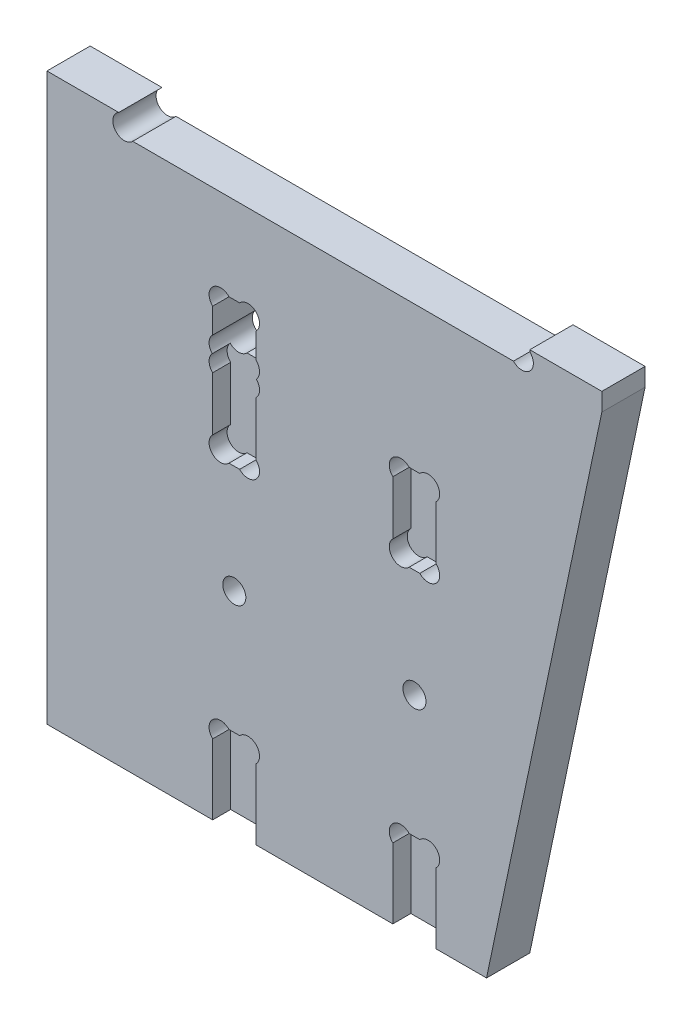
ISO-10303-21;
HEADER;
FILE_DESCRIPTION(('STEP AP214'),'2;1');
FILE_NAME('part.step','',(''),(''),'','','');
FILE_SCHEMA(('AUTOMOTIVE_DESIGN { 1 0 10303 214 1 1 1 1 }'));
ENDSEC;
DATA;
#1=APPLICATION_CONTEXT('core data for automotive mechanical design processes');
#2=APPLICATION_PROTOCOL_DEFINITION('international standard','automotive_design',2000,#1);
#3=PRODUCT_CONTEXT('',#1,'mechanical');
#4=PRODUCT('Part','Part','',(#3));
#5=PRODUCT_RELATED_PRODUCT_CATEGORY('part','',(#4));
#6=PRODUCT_DEFINITION_FORMATION('','',#4);
#7=PRODUCT_DEFINITION_CONTEXT('part definition',#1,'design');
#8=PRODUCT_DEFINITION('design','',#6,#7);
#9=PRODUCT_DEFINITION_SHAPE('','',#8);
#10=(LENGTH_UNIT() NAMED_UNIT(*) SI_UNIT(.MILLI.,.METRE.));
#11=(NAMED_UNIT(*) PLANE_ANGLE_UNIT() SI_UNIT($,.RADIAN.));
#12=(NAMED_UNIT(*) SI_UNIT($,.STERADIAN.) SOLID_ANGLE_UNIT());
#13=UNCERTAINTY_MEASURE_WITH_UNIT(LENGTH_MEASURE(1.E-05),#10,'distance_accuracy_value','');
#14=(GEOMETRIC_REPRESENTATION_CONTEXT(3) GLOBAL_UNCERTAINTY_ASSIGNED_CONTEXT((#13)) GLOBAL_UNIT_ASSIGNED_CONTEXT((#10,
#11,#12)) REPRESENTATION_CONTEXT('',''));
#15=CARTESIAN_POINT('',(0.,0.,0.));
#16=DIRECTION('',(0.,0.,1.));
#17=DIRECTION('',(1.,0.,0.));
#18=AXIS2_PLACEMENT_3D('',#15,#16,#17);
#19=CARTESIAN_POINT('',(-20.2585541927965,75.1,-6.));
#20=DIRECTION('',(0.,0.,1.));
#21=DIRECTION('',(1.,0.,0.));
#22=AXIS2_PLACEMENT_3D('',#19,#20,#21);
#23=CYLINDRICAL_SURFACE('',#22,1.6);
#24=DIRECTION('',(0.,0.,1.));
#25=VECTOR('',#24,1.);
#26=CARTESIAN_POINT('',(-21.033150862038,76.5,-6.));
#27=LINE('',#26,#25);
#28=CARTESIAN_POINT('',(-21.033150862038,76.5,0.));
#29=VERTEX_POINT('',#28);
#30=CARTESIAN_POINT('',(-21.033150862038,76.5,-6.));
#31=VERTEX_POINT('',#30);
#32=EDGE_CURVE('E326',#29,#31,#27,.F.);
#33=ORIENTED_EDGE('',*,*,#32,.F.);
#34=CARTESIAN_POINT('',(-20.2585541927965,75.1,0.));
#35=DIRECTION('',(0.,0.,-1.));
#36=DIRECTION('',(1.,0.,0.));
#37=AXIS2_PLACEMENT_3D('',#34,#35,#36);
#38=CIRCLE('',#37,1.6);
#39=CARTESIAN_POINT('',(-19.0966591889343,74.,0.));
#40=VERTEX_POINT('',#39);
#41=EDGE_CURVE('E334',#40,#29,#38,.T.);
#42=ORIENTED_EDGE('',*,*,#41,.F.);
#43=DIRECTION('',(0.,0.,1.));
#44=VECTOR('',#43,1.);
#45=CARTESIAN_POINT('',(-19.0966591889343,74.,-6.));
#46=LINE('',#45,#44);
#47=CARTESIAN_POINT('',(-19.0966591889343,74.,-6.));
#48=VERTEX_POINT('',#47);
#49=EDGE_CURVE('E353',#48,#40,#46,.T.);
#50=ORIENTED_EDGE('',*,*,#49,.F.);
#51=CARTESIAN_POINT('',(-20.2585541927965,75.1,-6.));
#52=DIRECTION('',(0.,0.,-1.));
#53=DIRECTION('',(1.,0.,0.));
#54=AXIS2_PLACEMENT_3D('',#51,#52,#53);
#55=CIRCLE('',#54,1.6);
#56=EDGE_CURVE('E337',#48,#31,#55,.T.);
#57=ORIENTED_EDGE('',*,*,#56,.T.);
#58=EDGE_LOOP('',(#33,#42,#50,#57));
#59=FACE_BOUND('',#58,.T.);
#60=ADVANCED_FACE('F35',(#59),#23,.F.);
#61=CARTESIAN_POINT('',(33.7381049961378,74.,-6.));
#62=DIRECTION('',(0.,1.,0.));
#63=DIRECTION('',(-1.,0.,0.));
#64=AXIS2_PLACEMENT_3D('',#61,#62,#63);
#65=PLANE('',#64);
#66=DIRECTION('',(-1.,0.,0.));
#67=VECTOR('',#66,1.);
#68=CARTESIAN_POINT('',(33.7381049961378,74.,0.));
#69=LINE('',#68,#67);
#70=CARTESIAN_POINT('',(33.7381049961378,74.,0.));
#71=VERTEX_POINT('',#70);
#72=EDGE_CURVE('E344',#71,#40,#69,.T.);
#73=ORIENTED_EDGE('',*,*,#72,.F.);
#74=DIRECTION('',(0.,0.,1.));
#75=VECTOR('',#74,1.);
#76=CARTESIAN_POINT('',(33.7381049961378,74.,-6.));
#77=LINE('',#76,#75);
#78=CARTESIAN_POINT('',(33.7381049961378,74.,-6.));
#79=VERTEX_POINT('',#78);
#80=EDGE_CURVE('E356',#79,#71,#77,.T.);
#81=ORIENTED_EDGE('',*,*,#80,.F.);
#82=DIRECTION('',(-1.,0.,0.));
#83=VECTOR('',#82,1.);
#84=CARTESIAN_POINT('',(33.7381049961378,74.,-6.));
#85=LINE('',#84,#83);
#86=EDGE_CURVE('E420',#79,#48,#85,.T.);
#87=ORIENTED_EDGE('',*,*,#86,.T.);
#88=ORIENTED_EDGE('',*,*,#49,.T.);
#89=EDGE_LOOP('',(#73,#81,#87,#88));
#90=FACE_BOUND('',#89,.T.);
#91=ADVANCED_FACE('F419',(#90),#65,.T.);
#92=CARTESIAN_POINT('',(34.9,75.1,-6.));
#93=DIRECTION('',(0.,0.,1.));
#94=DIRECTION('',(1.,0.,0.));
#95=AXIS2_PLACEMENT_3D('',#92,#93,#94);
#96=CYLINDRICAL_SURFACE('',#95,1.6);
#97=CARTESIAN_POINT('',(34.9,75.1,0.));
#98=DIRECTION('',(0.,0.,-1.));
#99=DIRECTION('',(1.,0.,0.));
#100=AXIS2_PLACEMENT_3D('',#97,#98,#99);
#101=CIRCLE('',#100,1.6);
#102=CARTESIAN_POINT('',(36.,76.2618950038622,0.));
#103=VERTEX_POINT('',#102);
#104=EDGE_CURVE('E349',#103,#71,#101,.T.);
#105=ORIENTED_EDGE('',*,*,#104,.F.);
#106=DIRECTION('',(0.,0.,1.));
#107=VECTOR('',#106,1.);
#108=CARTESIAN_POINT('',(36.,76.2618950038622,-6.));
#109=LINE('',#108,#107);
#110=CARTESIAN_POINT('',(36.,76.2618950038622,-6.));
#111=VERTEX_POINT('',#110);
#112=EDGE_CURVE('E358',#111,#103,#109,.T.);
#113=ORIENTED_EDGE('',*,*,#112,.F.);
#114=CARTESIAN_POINT('',(34.9,75.1,-6.));
#115=DIRECTION('',(0.,0.,-1.));
#116=DIRECTION('',(1.,0.,0.));
#117=AXIS2_PLACEMENT_3D('',#114,#115,#116);
#118=CIRCLE('',#117,1.6);
#119=EDGE_CURVE('E415',#111,#79,#118,.T.);
#120=ORIENTED_EDGE('',*,*,#119,.T.);
#121=ORIENTED_EDGE('',*,*,#80,.T.);
#122=EDGE_LOOP('',(#105,#113,#120,#121));
#123=FACE_BOUND('',#122,.T.);
#124=ADVANCED_FACE('F412',(#123),#96,.F.);
#125=CARTESIAN_POINT('',(36.,80.,-6.));
#126=DIRECTION('',(-1.,0.,0.));
#127=DIRECTION('',(0.,-1.,0.));
#128=AXIS2_PLACEMENT_3D('',#125,#126,#127);
#129=PLANE('',#128);
#130=DIRECTION('',(0.,0.,1.));
#131=VECTOR('',#130,1.);
#132=CARTESIAN_POINT('',(36.,76.5,-6.));
#133=LINE('',#132,#131);
#134=CARTESIAN_POINT('',(36.,76.5,-6.));
#135=VERTEX_POINT('',#134);
#136=CARTESIAN_POINT('',(36.,76.5,0.));
#137=VERTEX_POINT('',#136);
#138=EDGE_CURVE('E57',#135,#137,#133,.T.);
#139=ORIENTED_EDGE('',*,*,#138,.F.);
#140=DIRECTION('',(0.,-1.,0.));
#141=VECTOR('',#140,1.);
#142=CARTESIAN_POINT('',(36.,80.,-6.));
#143=LINE('',#142,#141);
#144=EDGE_CURVE('E452',#135,#111,#143,.T.);
#145=ORIENTED_EDGE('',*,*,#144,.T.);
#146=ORIENTED_EDGE('',*,*,#112,.T.);
#147=DIRECTION('',(0.,-1.,0.));
#148=VECTOR('',#147,1.);
#149=CARTESIAN_POINT('',(36.,80.,0.));
#150=LINE('',#149,#148);
#151=EDGE_CURVE('E403',#137,#103,#150,.T.);
#152=ORIENTED_EDGE('',*,*,#151,.F.);
#153=EDGE_LOOP('',(#139,#145,#146,#152));
#154=FACE_BOUND('',#153,.T.);
#155=ADVANCED_FACE('F816',(#154),#129,.T.);
#156=CARTESIAN_POINT('',(46.,74.,-6.));
#157=DIRECTION('',(1.,0.,0.));
#158=DIRECTION('',(0.,1.,0.));
#159=AXIS2_PLACEMENT_3D('',#156,#157,#158);
#160=PLANE('',#159);
#161=DIRECTION('',(0.,0.,-1.));
#162=VECTOR('',#161,1.);
#163=CARTESIAN_POINT('',(46.,76.5,-6.));
#164=LINE('',#163,#162);
#165=CARTESIAN_POINT('',(46.,76.5,0.));
#166=VERTEX_POINT('',#165);
#167=CARTESIAN_POINT('',(46.,76.5,-6.));
#168=VERTEX_POINT('',#167);
#169=EDGE_CURVE('E387',#166,#168,#164,.T.);
#170=ORIENTED_EDGE('',*,*,#169,.F.);
#171=DIRECTION('',(0.,1.,0.));
#172=VECTOR('',#171,1.);
#173=CARTESIAN_POINT('',(46.,74.,0.));
#174=LINE('',#173,#172);
#175=CARTESIAN_POINT('',(46.,74.,0.));
#176=VERTEX_POINT('',#175);
#177=EDGE_CURVE('E395',#176,#166,#174,.T.);
#178=ORIENTED_EDGE('',*,*,#177,.F.);
#179=DIRECTION('',(0.,0.,1.));
#180=VECTOR('',#179,1.);
#181=CARTESIAN_POINT('',(46.,74.,-6.));
#182=LINE('',#181,#180);
#183=CARTESIAN_POINT('',(46.,74.,-6.));
#184=VERTEX_POINT('',#183);
#185=EDGE_CURVE('E361',#184,#176,#182,.T.);
#186=ORIENTED_EDGE('',*,*,#185,.F.);
#187=DIRECTION('',(0.,1.,0.));
#188=VECTOR('',#187,1.);
#189=CARTESIAN_POINT('',(46.,74.,-6.));
#190=LINE('',#189,#188);
#191=EDGE_CURVE('E398',#184,#168,#190,.T.);
#192=ORIENTED_EDGE('',*,*,#191,.T.);
#193=EDGE_LOOP('',(#170,#178,#186,#192));
#194=FACE_BOUND('',#193,.T.);
#195=ADVANCED_FACE('F394',(#194),#160,.T.);
#196=CARTESIAN_POINT('',(30.,-2.,-6.));
#197=DIRECTION('',(0.978549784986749,-0.206010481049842,0.));
#198=DIRECTION('',(0.206010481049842,0.978549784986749,0.));
#199=AXIS2_PLACEMENT_3D('',#196,#197,#198);
#200=PLANE('',#199);
#201=DIRECTION('',(0.206010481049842,0.978549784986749,0.));
#202=VECTOR('',#201,1.);
#203=CARTESIAN_POINT('',(30.,-2.,0.));
#204=LINE('',#203,#202);
#205=CARTESIAN_POINT('',(30.,-2.,0.));
#206=VERTEX_POINT('',#205);
#207=EDGE_CURVE('E402',#206,#176,#204,.T.);
#208=ORIENTED_EDGE('',*,*,#207,.F.);
#209=DIRECTION('',(0.,0.,1.));
#210=VECTOR('',#209,1.);
#211=CARTESIAN_POINT('',(30.,-2.,-6.));
#212=LINE('',#211,#210);
#213=CARTESIAN_POINT('',(30.,-2.,-6.));
#214=VERTEX_POINT('',#213);
#215=EDGE_CURVE('E363',#214,#206,#212,.T.);
#216=ORIENTED_EDGE('',*,*,#215,.F.);
#217=DIRECTION('',(0.206010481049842,0.978549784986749,0.));
#218=VECTOR('',#217,1.);
#219=CARTESIAN_POINT('',(30.,-2.,-6.));
#220=LINE('',#219,#218);
#221=EDGE_CURVE('E450',#214,#184,#220,.T.);
#222=ORIENTED_EDGE('',*,*,#221,.T.);
#223=ORIENTED_EDGE('',*,*,#185,.T.);
#224=EDGE_LOOP('',(#208,#216,#222,#223));
#225=FACE_BOUND('',#224,.T.);
#226=ADVANCED_FACE('F449',(#225),#200,.T.);
#227=CARTESIAN_POINT('',(23.,-2.,-6.));
#228=DIRECTION('',(0.,-1.,0.));
#229=DIRECTION('',(1.,0.,0.));
#230=AXIS2_PLACEMENT_3D('',#227,#228,#229);
#231=PLANE('',#230);
#232=DIRECTION('',(0.,0.,-1.));
#233=VECTOR('',#232,1.);
#234=CARTESIAN_POINT('',(-7.99999999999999,-2.,-6.));
#235=LINE('',#234,#233);
#236=CARTESIAN_POINT('',(-7.99999999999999,-2.,0.));
#237=VERTEX_POINT('',#236);
#238=CARTESIAN_POINT('',(-7.99999999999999,-2.,-2.5));
#239=VERTEX_POINT('',#238);
#240=EDGE_CURVE('E615',#237,#239,#235,.T.);
#241=ORIENTED_EDGE('',*,*,#240,.F.);
#242=DIRECTION('',(1.,0.,0.));
#243=VECTOR('',#242,1.);
#244=CARTESIAN_POINT('',(23.,-2.,0.));
#245=LINE('',#244,#243);
#246=CARTESIAN_POINT('',(-31.,-2.00000000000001,0.));
#247=VERTEX_POINT('',#246);
#248=EDGE_CURVE('E406',#247,#237,#245,.T.);
#249=ORIENTED_EDGE('',*,*,#248,.F.);
#250=DIRECTION('',(0.,0.,1.));
#251=VECTOR('',#250,1.);
#252=CARTESIAN_POINT('',(-31.,-2.00000000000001,-6.));
#253=LINE('',#252,#251);
#254=CARTESIAN_POINT('',(-31.,-2.00000000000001,-6.));
#255=VERTEX_POINT('',#254);
#256=EDGE_CURVE('E366',#255,#247,#253,.T.);
#257=ORIENTED_EDGE('',*,*,#256,.F.);
#258=DIRECTION('',(1.,0.,0.));
#259=VECTOR('',#258,1.);
#260=CARTESIAN_POINT('',(-5.99999999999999,-2.,-6.));
#261=LINE('',#260,#259);
#262=EDGE_CURVE('E347',#255,#214,#261,.T.);
#263=ORIENTED_EDGE('',*,*,#262,.T.);
#264=ORIENTED_EDGE('',*,*,#215,.T.);
#265=CARTESIAN_POINT('',(23.,-2.,0.));
#266=VERTEX_POINT('',#265);
#267=EDGE_CURVE('E430',#266,#206,#245,.T.);
#268=ORIENTED_EDGE('',*,*,#267,.F.);
#269=DIRECTION('',(0.,0.,1.));
#270=VECTOR('',#269,1.);
#271=CARTESIAN_POINT('',(23.,-2.,-6.));
#272=LINE('',#271,#270);
#273=CARTESIAN_POINT('',(23.,-2.,-2.5));
#274=VERTEX_POINT('',#273);
#275=EDGE_CURVE('E566',#274,#266,#272,.T.);
#276=ORIENTED_EDGE('',*,*,#275,.F.);
#277=DIRECTION('',(-1.,0.,0.));
#278=VECTOR('',#277,1.);
#279=CARTESIAN_POINT('',(23.,-2.,-2.5));
#280=LINE('',#279,#278);
#281=CARTESIAN_POINT('',(17.,-2.,-2.5));
#282=VERTEX_POINT('',#281);
#283=EDGE_CURVE('E370',#274,#282,#280,.T.);
#284=ORIENTED_EDGE('',*,*,#283,.T.);
#285=DIRECTION('',(0.,0.,-1.));
#286=VECTOR('',#285,1.);
#287=CARTESIAN_POINT('',(17.,-2.,-6.));
#288=LINE('',#287,#286);
#289=CARTESIAN_POINT('',(17.,-2.,0.));
#290=VERTEX_POINT('',#289);
#291=EDGE_CURVE('E590',#290,#282,#288,.T.);
#292=ORIENTED_EDGE('',*,*,#291,.F.);
#293=CARTESIAN_POINT('',(-1.99999999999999,-2.,0.));
#294=VERTEX_POINT('',#293);
#295=EDGE_CURVE('E433',#294,#290,#245,.T.);
#296=ORIENTED_EDGE('',*,*,#295,.F.);
#297=DIRECTION('',(0.,0.,1.));
#298=VECTOR('',#297,1.);
#299=CARTESIAN_POINT('',(-2.,-2.,-6.));
#300=LINE('',#299,#298);
#301=CARTESIAN_POINT('',(-2.,-2.,-2.5));
#302=VERTEX_POINT('',#301);
#303=EDGE_CURVE('E629',#302,#294,#300,.T.);
#304=ORIENTED_EDGE('',*,*,#303,.F.);
#305=DIRECTION('',(-1.,0.,0.));
#306=VECTOR('',#305,1.);
#307=CARTESIAN_POINT('',(23.,-2.,-2.5));
#308=LINE('',#307,#306);
#309=EDGE_CURVE('E375',#302,#239,#308,.T.);
#310=ORIENTED_EDGE('',*,*,#309,.T.);
#311=EDGE_LOOP('',(#241,#249,#257,#263,#264,#268,#276,#284,#292,#296,#304,#310));
#312=FACE_BOUND('',#311,.T.);
#313=ADVANCED_FACE('F443',(#312),#231,.T.);
#314=CARTESIAN_POINT('',(-31.,-2.00000000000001,-6.));
#315=DIRECTION('',(-1.,0.,0.));
#316=DIRECTION('',(0.,-1.,0.));
#317=AXIS2_PLACEMENT_3D('',#314,#315,#316);
#318=PLANE('',#317);
#319=DIRECTION('',(0.,0.,1.));
#320=VECTOR('',#319,1.);
#321=CARTESIAN_POINT('',(-31.0000000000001,76.5,-6.));
#322=LINE('',#321,#320);
#323=CARTESIAN_POINT('',(-31.,76.5,-6.));
#324=VERTEX_POINT('',#323);
#325=CARTESIAN_POINT('',(-31.0000000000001,76.5,0.));
#326=VERTEX_POINT('',#325);
#327=EDGE_CURVE('E49',#324,#326,#322,.T.);
#328=ORIENTED_EDGE('',*,*,#327,.F.);
#329=DIRECTION('',(0.,-1.,0.));
#330=VECTOR('',#329,1.);
#331=CARTESIAN_POINT('',(-31.,74.,-6.));
#332=LINE('',#331,#330);
#333=EDGE_CURVE('E345',#324,#255,#332,.T.);
#334=ORIENTED_EDGE('',*,*,#333,.T.);
#335=ORIENTED_EDGE('',*,*,#256,.T.);
#336=DIRECTION('',(0.,-1.,0.));
#337=VECTOR('',#336,1.);
#338=CARTESIAN_POINT('',(-31.,-2.00000000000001,0.));
#339=LINE('',#338,#337);
#340=EDGE_CURVE('E429',#326,#247,#339,.T.);
#341=ORIENTED_EDGE('',*,*,#340,.F.);
#342=EDGE_LOOP('',(#328,#334,#335,#341));
#343=FACE_BOUND('',#342,.T.);
#344=ADVANCED_FACE('F37',(#343),#318,.T.);
#345=CARTESIAN_POINT('',(-20.2585541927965,75.1,-6.));
#346=DIRECTION('',(0.,0.,1.));
#347=DIRECTION('',(1.,0.,0.));
#348=AXIS2_PLACEMENT_3D('',#345,#346,#347);
#349=PLANE('',#348);
#350=DIRECTION('',(0.,-1.,0.));
#351=VECTOR('',#350,1.);
#352=CARTESIAN_POINT('',(-8.,75.1,-6.));
#353=LINE('',#352,#351);
#354=CARTESIAN_POINT('',(-8.,59.7381049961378,-6.));
#355=VERTEX_POINT('',#354);
#356=CARTESIAN_POINT('',(-8.,56.2618950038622,-6.));
#357=VERTEX_POINT('',#356);
#358=EDGE_CURVE('E653',#355,#357,#353,.T.);
#359=ORIENTED_EDGE('',*,*,#358,.T.);
#360=CARTESIAN_POINT('',(-6.9,55.1,-6.));
#361=DIRECTION('',(0.,0.,1.));
#362=DIRECTION('',(1.,0.,0.));
#363=AXIS2_PLACEMENT_3D('',#360,#361,#362);
#364=CIRCLE('',#363,1.6);
#365=CARTESIAN_POINT('',(-5.73810499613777,54.,-6.));
#366=VERTEX_POINT('',#365);
#367=EDGE_CURVE('E680',#357,#366,#364,.T.);
#368=ORIENTED_EDGE('',*,*,#367,.T.);
#369=DIRECTION('',(1.,0.,0.));
#370=VECTOR('',#369,1.);
#371=CARTESIAN_POINT('',(-20.2585541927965,54.,-6.));
#372=LINE('',#371,#370);
#373=CARTESIAN_POINT('',(-4.26189500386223,54.,-6.));
#374=VERTEX_POINT('',#373);
#375=EDGE_CURVE('E692',#366,#374,#372,.T.);
#376=ORIENTED_EDGE('',*,*,#375,.T.);
#377=CARTESIAN_POINT('',(-3.1,55.1,-6.));
#378=DIRECTION('',(0.,0.,1.));
#379=DIRECTION('',(1.,0.,0.));
#380=AXIS2_PLACEMENT_3D('',#377,#378,#379);
#381=CIRCLE('',#380,1.6);
#382=CARTESIAN_POINT('',(-2.,56.2618950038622,-6.));
#383=VERTEX_POINT('',#382);
#384=EDGE_CURVE('E686',#374,#383,#381,.T.);
#385=ORIENTED_EDGE('',*,*,#384,.T.);
#386=DIRECTION('',(0.,1.,0.));
#387=VECTOR('',#386,1.);
#388=CARTESIAN_POINT('',(-2.,75.1,-6.));
#389=LINE('',#388,#387);
#390=CARTESIAN_POINT('',(-2.,59.7381049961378,-6.));
#391=VERTEX_POINT('',#390);
#392=EDGE_CURVE('E677',#383,#391,#389,.T.);
#393=ORIENTED_EDGE('',*,*,#392,.T.);
#394=CARTESIAN_POINT('',(-3.1,60.9,-6.));
#395=DIRECTION('',(0.,0.,1.));
#396=DIRECTION('',(1.,0.,0.));
#397=AXIS2_PLACEMENT_3D('',#394,#395,#396);
#398=CIRCLE('',#397,1.6);
#399=CARTESIAN_POINT('',(-4.26189500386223,62.,-6.));
#400=VERTEX_POINT('',#399);
#401=EDGE_CURVE('E674',#391,#400,#398,.T.);
#402=ORIENTED_EDGE('',*,*,#401,.T.);
#403=DIRECTION('',(-1.,0.,0.));
#404=VECTOR('',#403,1.);
#405=CARTESIAN_POINT('',(-20.2585541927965,62.,-6.));
#406=LINE('',#405,#404);
#407=CARTESIAN_POINT('',(-5.73810499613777,62.,-6.));
#408=VERTEX_POINT('',#407);
#409=EDGE_CURVE('E671',#400,#408,#406,.T.);
#410=ORIENTED_EDGE('',*,*,#409,.T.);
#411=CARTESIAN_POINT('',(-6.9,60.9,-6.));
#412=DIRECTION('',(0.,0.,1.));
#413=DIRECTION('',(1.,0.,0.));
#414=AXIS2_PLACEMENT_3D('',#411,#412,#413);
#415=CIRCLE('',#414,1.6);
#416=EDGE_CURVE('E668',#408,#355,#415,.T.);
#417=ORIENTED_EDGE('',*,*,#416,.T.);
#418=EDGE_LOOP('',(#359,#368,#376,#385,#393,#402,#410,#417));
#419=FACE_BOUND('',#418,.T.);
#420=CARTESIAN_POINT('',(20.,27.,-6.));
#421=DIRECTION('',(0.,0.,1.));
#422=DIRECTION('',(1.,0.,0.));
#423=AXIS2_PLACEMENT_3D('',#420,#421,#422);
#424=CIRCLE('',#423,1.6);
#425=CARTESIAN_POINT('',(21.6,27.,-6.));
#426=VERTEX_POINT('',#425);
#427=EDGE_CURVE('E461',#426,#426,#424,.T.);
#428=ORIENTED_EDGE('',*,*,#427,.T.);
#429=EDGE_LOOP('',(#428));
#430=FACE_BOUND('',#429,.T.);
#431=CARTESIAN_POINT('',(-5.,27.,-6.));
#432=DIRECTION('',(0.,0.,1.));
#433=DIRECTION('',(1.,0.,0.));
#434=AXIS2_PLACEMENT_3D('',#431,#432,#433);
#435=CIRCLE('',#434,1.6);
#436=CARTESIAN_POINT('',(-3.4,27.,-6.));
#437=VERTEX_POINT('',#436);
#438=EDGE_CURVE('E431',#437,#437,#435,.T.);
#439=ORIENTED_EDGE('',*,*,#438,.T.);
#440=EDGE_LOOP('',(#439));
#441=FACE_BOUND('',#440,.T.);
#442=ORIENTED_EDGE('',*,*,#333,.F.);
#443=DIRECTION('',(1.,0.,0.));
#444=VECTOR('',#443,1.);
#445=CARTESIAN_POINT('',(-20.2585541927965,76.5,-6.));
#446=LINE('',#445,#444);
#447=EDGE_CURVE('E424',#324,#31,#446,.T.);
#448=ORIENTED_EDGE('',*,*,#447,.T.);
#449=ORIENTED_EDGE('',*,*,#56,.F.);
#450=ORIENTED_EDGE('',*,*,#86,.F.);
#451=ORIENTED_EDGE('',*,*,#119,.F.);
#452=ORIENTED_EDGE('',*,*,#144,.F.);
#453=EDGE_CURVE('E399',#135,#168,#446,.T.);
#454=ORIENTED_EDGE('',*,*,#453,.T.);
#455=ORIENTED_EDGE('',*,*,#191,.F.);
#456=ORIENTED_EDGE('',*,*,#221,.F.);
#457=ORIENTED_EDGE('',*,*,#262,.F.);
#458=EDGE_LOOP('',(#442,#448,#449,#450,#451,#452,#454,#455,#456,#457));
#459=FACE_BOUND('',#458,.T.);
#460=ADVANCED_FACE('F423',(#419,#430,#441,#459),#349,.F.);
#461=CARTESIAN_POINT('',(-20.2585541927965,75.1,0.));
#462=DIRECTION('',(0.,0.,1.));
#463=DIRECTION('',(1.,0.,0.));
#464=AXIS2_PLACEMENT_3D('',#461,#462,#463);
#465=PLANE('',#464);
#466=DIRECTION('',(1.,0.,0.));
#467=VECTOR('',#466,1.);
#468=CARTESIAN_POINT('',(-20.2585541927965,76.5,0.));
#469=LINE('',#468,#467);
#470=EDGE_CURVE('E11',#326,#29,#469,.T.);
#471=ORIENTED_EDGE('',*,*,#470,.F.);
#472=ORIENTED_EDGE('',*,*,#340,.T.);
#473=ORIENTED_EDGE('',*,*,#248,.T.);
#474=DIRECTION('',(0.,-1.,0.));
#475=VECTOR('',#474,1.);
#476=CARTESIAN_POINT('',(-7.99999999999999,-2.,0.));
#477=LINE('',#476,#475);
#478=CARTESIAN_POINT('',(-7.99999999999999,7.73810499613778,0.));
#479=VERTEX_POINT('',#478);
#480=EDGE_CURVE('E641',#479,#237,#477,.T.);
#481=ORIENTED_EDGE('',*,*,#480,.F.);
#482=CARTESIAN_POINT('',(-6.9,8.90000000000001,0.));
#483=DIRECTION('',(0.,0.,1.));
#484=DIRECTION('',(1.,0.,0.));
#485=AXIS2_PLACEMENT_3D('',#482,#483,#484);
#486=CIRCLE('',#485,1.6);
#487=CARTESIAN_POINT('',(-5.73810499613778,10.,0.));
#488=VERTEX_POINT('',#487);
#489=EDGE_CURVE('E644',#488,#479,#486,.T.);
#490=ORIENTED_EDGE('',*,*,#489,.F.);
#491=DIRECTION('',(-1.,0.,0.));
#492=VECTOR('',#491,1.);
#493=CARTESIAN_POINT('',(-5.73810499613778,10.,0.));
#494=LINE('',#493,#492);
#495=CARTESIAN_POINT('',(-4.26189500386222,10.,0.));
#496=VERTEX_POINT('',#495);
#497=EDGE_CURVE('E647',#496,#488,#494,.T.);
#498=ORIENTED_EDGE('',*,*,#497,.F.);
#499=CARTESIAN_POINT('',(-3.09999999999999,8.90000000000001,0.));
#500=DIRECTION('',(0.,0.,1.));
#501=DIRECTION('',(1.,0.,0.));
#502=AXIS2_PLACEMENT_3D('',#499,#500,#501);
#503=CIRCLE('',#502,1.6);
#504=CARTESIAN_POINT('',(-2.,7.73810499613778,0.));
#505=VERTEX_POINT('',#504);
#506=EDGE_CURVE('E650',#505,#496,#503,.T.);
#507=ORIENTED_EDGE('',*,*,#506,.F.);
#508=DIRECTION('',(0.,1.,0.));
#509=VECTOR('',#508,1.);
#510=CARTESIAN_POINT('',(-1.99999999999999,75.1,0.));
#511=LINE('',#510,#509);
#512=EDGE_CURVE('E373',#294,#505,#511,.T.);
#513=ORIENTED_EDGE('',*,*,#512,.F.);
#514=ORIENTED_EDGE('',*,*,#295,.T.);
#515=DIRECTION('',(0.,-1.,0.));
#516=VECTOR('',#515,1.);
#517=CARTESIAN_POINT('',(17.,-2.,0.));
#518=LINE('',#517,#516);
#519=CARTESIAN_POINT('',(17.,7.73810499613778,0.));
#520=VERTEX_POINT('',#519);
#521=EDGE_CURVE('E610',#520,#290,#518,.T.);
#522=ORIENTED_EDGE('',*,*,#521,.F.);
#523=CARTESIAN_POINT('',(18.1,8.90000000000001,0.));
#524=DIRECTION('',(0.,0.,1.));
#525=DIRECTION('',(1.,0.,0.));
#526=AXIS2_PLACEMENT_3D('',#523,#524,#525);
#527=CIRCLE('',#526,1.6);
#528=CARTESIAN_POINT('',(19.2618950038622,10.,0.));
#529=VERTEX_POINT('',#528);
#530=EDGE_CURVE('E613',#529,#520,#527,.T.);
#531=ORIENTED_EDGE('',*,*,#530,.F.);
#532=DIRECTION('',(-1.,0.,0.));
#533=VECTOR('',#532,1.);
#534=CARTESIAN_POINT('',(19.2618950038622,10.,0.));
#535=LINE('',#534,#533);
#536=CARTESIAN_POINT('',(20.7381049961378,10.,0.));
#537=VERTEX_POINT('',#536);
#538=EDGE_CURVE('E603',#537,#529,#535,.T.);
#539=ORIENTED_EDGE('',*,*,#538,.F.);
#540=CARTESIAN_POINT('',(21.9,8.90000000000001,0.));
#541=DIRECTION('',(0.,0.,1.));
#542=DIRECTION('',(1.,0.,0.));
#543=AXIS2_PLACEMENT_3D('',#540,#541,#542);
#544=CIRCLE('',#543,1.6);
#545=CARTESIAN_POINT('',(23.,7.73810499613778,0.));
#546=VERTEX_POINT('',#545);
#547=EDGE_CURVE('E607',#546,#537,#544,.T.);
#548=ORIENTED_EDGE('',*,*,#547,.F.);
#549=DIRECTION('',(0.,1.,0.));
#550=VECTOR('',#549,1.);
#551=CARTESIAN_POINT('',(23.,75.1,0.));
#552=LINE('',#551,#550);
#553=EDGE_CURVE('E355',#266,#546,#552,.T.);
#554=ORIENTED_EDGE('',*,*,#553,.F.);
#555=ORIENTED_EDGE('',*,*,#267,.T.);
#556=ORIENTED_EDGE('',*,*,#207,.T.);
#557=ORIENTED_EDGE('',*,*,#177,.T.);
#558=EDGE_CURVE('E39',#137,#166,#469,.T.);
#559=ORIENTED_EDGE('',*,*,#558,.F.);
#560=ORIENTED_EDGE('',*,*,#151,.T.);
#561=ORIENTED_EDGE('',*,*,#104,.T.);
#562=ORIENTED_EDGE('',*,*,#72,.T.);
#563=ORIENTED_EDGE('',*,*,#41,.T.);
#564=EDGE_LOOP('',(#471,#472,#473,#481,#490,#498,#507,#513,#514,#522,#531,#539,#548,#554,#555,
#556,#557,#559,#560,#561,#562,#563));
#565=FACE_BOUND('',#564,.T.);
#566=CARTESIAN_POINT('',(-6.9,55.1,0.));
#567=DIRECTION('',(0.,0.,1.));
#568=DIRECTION('',(-1.,0.,0.));
#569=AXIS2_PLACEMENT_3D('',#566,#567,#568);
#570=CIRCLE('',#569,1.6);
#571=CARTESIAN_POINT('',(-8.,56.2618950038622,0.));
#572=VERTEX_POINT('',#571);
#573=CARTESIAN_POINT('',(-8.06189500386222,54.,0.));
#574=VERTEX_POINT('',#573);
#575=EDGE_CURVE('E338',#572,#574,#570,.T.);
#576=ORIENTED_EDGE('',*,*,#575,.F.);
#577=DIRECTION('',(0.,-1.,0.));
#578=VECTOR('',#577,1.);
#579=CARTESIAN_POINT('',(-8.,59.7381049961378,0.));
#580=LINE('',#579,#578);
#581=CARTESIAN_POINT('',(-8.,59.7381049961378,0.));
#582=VERTEX_POINT('',#581);
#583=EDGE_CURVE('E699',#582,#572,#580,.T.);
#584=ORIENTED_EDGE('',*,*,#583,.F.);
#585=CARTESIAN_POINT('',(-6.9,60.9,0.));
#586=DIRECTION('',(0.,0.,1.));
#587=DIRECTION('',(1.,0.,0.));
#588=AXIS2_PLACEMENT_3D('',#585,#586,#587);
#589=CIRCLE('',#588,1.6);
#590=CARTESIAN_POINT('',(-5.73810499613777,62.,0.));
#591=VERTEX_POINT('',#590);
#592=EDGE_CURVE('E715',#591,#582,#589,.T.);
#593=ORIENTED_EDGE('',*,*,#592,.F.);
#594=DIRECTION('',(-1.,0.,0.));
#595=VECTOR('',#594,1.);
#596=CARTESIAN_POINT('',(-5.73810499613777,62.,0.));
#597=LINE('',#596,#595);
#598=CARTESIAN_POINT('',(-4.26189500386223,62.,0.));
#599=VERTEX_POINT('',#598);
#600=EDGE_CURVE('E718',#599,#591,#597,.T.);
#601=ORIENTED_EDGE('',*,*,#600,.F.);
#602=CARTESIAN_POINT('',(-3.1,60.9,0.));
#603=DIRECTION('',(0.,0.,1.));
#604=DIRECTION('',(1.,0.,0.));
#605=AXIS2_PLACEMENT_3D('',#602,#603,#604);
#606=CIRCLE('',#605,1.6);
#607=CARTESIAN_POINT('',(-2.,59.7381049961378,0.));
#608=VERTEX_POINT('',#607);
#609=EDGE_CURVE('E721',#608,#599,#606,.T.);
#610=ORIENTED_EDGE('',*,*,#609,.F.);
#611=DIRECTION('',(0.,1.,0.));
#612=VECTOR('',#611,1.);
#613=CARTESIAN_POINT('',(-2.,59.7381049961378,0.));
#614=LINE('',#613,#612);
#615=CARTESIAN_POINT('',(-2.,56.2618950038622,0.));
#616=VERTEX_POINT('',#615);
#617=EDGE_CURVE('E724',#616,#608,#614,.T.);
#618=ORIENTED_EDGE('',*,*,#617,.F.);
#619=CARTESIAN_POINT('',(-3.1,55.1,0.));
#620=DIRECTION('',(0.,0.,1.));
#621=DIRECTION('',(1.,0.,0.));
#622=AXIS2_PLACEMENT_3D('',#619,#620,#621);
#623=CIRCLE('',#622,1.6);
#624=CARTESIAN_POINT('',(-1.93810499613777,54.,0.));
#625=VERTEX_POINT('',#624);
#626=EDGE_CURVE('E727',#625,#616,#623,.T.);
#627=ORIENTED_EDGE('',*,*,#626,.F.);
#628=CARTESIAN_POINT('',(-3.1,52.9,0.));
#629=DIRECTION('',(0.,0.,1.));
#630=DIRECTION('',(1.,0.,0.));
#631=AXIS2_PLACEMENT_3D('',#628,#629,#630);
#632=CIRCLE('',#631,1.6);
#633=CARTESIAN_POINT('',(-2.,51.7381049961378,0.));
#634=VERTEX_POINT('',#633);
#635=EDGE_CURVE('E501',#634,#625,#632,.T.);
#636=ORIENTED_EDGE('',*,*,#635,.F.);
#637=DIRECTION('',(0.,1.,0.));
#638=VECTOR('',#637,1.);
#639=CARTESIAN_POINT('',(-2.,51.7381049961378,0.));
#640=LINE('',#639,#638);
#641=CARTESIAN_POINT('',(-2.,44.2618950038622,0.));
#642=VERTEX_POINT('',#641);
#643=EDGE_CURVE('E483',#642,#634,#640,.T.);
#644=ORIENTED_EDGE('',*,*,#643,.F.);
#645=CARTESIAN_POINT('',(-3.1,43.1,0.));
#646=DIRECTION('',(0.,0.,1.));
#647=DIRECTION('',(1.,0.,0.));
#648=AXIS2_PLACEMENT_3D('',#645,#646,#647);
#649=CIRCLE('',#648,1.6);
#650=CARTESIAN_POINT('',(-4.26189500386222,42.,0.));
#651=VERTEX_POINT('',#650);
#652=EDGE_CURVE('E487',#651,#642,#649,.T.);
#653=ORIENTED_EDGE('',*,*,#652,.F.);
#654=DIRECTION('',(1.,0.,0.));
#655=VECTOR('',#654,1.);
#656=CARTESIAN_POINT('',(-4.26189500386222,42.,0.));
#657=LINE('',#656,#655);
#658=CARTESIAN_POINT('',(-5.73810499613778,42.,0.));
#659=VERTEX_POINT('',#658);
#660=EDGE_CURVE('E490',#659,#651,#657,.T.);
#661=ORIENTED_EDGE('',*,*,#660,.F.);
#662=CARTESIAN_POINT('',(-6.9,43.1,0.));
#663=DIRECTION('',(0.,0.,1.));
#664=DIRECTION('',(1.,0.,0.));
#665=AXIS2_PLACEMENT_3D('',#662,#663,#664);
#666=CIRCLE('',#665,1.6);
#667=CARTESIAN_POINT('',(-8.,44.2618950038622,0.));
#668=VERTEX_POINT('',#667);
#669=EDGE_CURVE('E493',#668,#659,#666,.T.);
#670=ORIENTED_EDGE('',*,*,#669,.F.);
#671=DIRECTION('',(0.,-1.,0.));
#672=VECTOR('',#671,1.);
#673=CARTESIAN_POINT('',(-8.,51.7381049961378,0.));
#674=LINE('',#673,#672);
#675=CARTESIAN_POINT('',(-8.,51.7381049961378,0.));
#676=VERTEX_POINT('',#675);
#677=EDGE_CURVE('E496',#676,#668,#674,.T.);
#678=ORIENTED_EDGE('',*,*,#677,.F.);
#679=CARTESIAN_POINT('',(-6.9,52.9,0.));
#680=DIRECTION('',(0.,0.,1.));
#681=DIRECTION('',(-1.,0.,0.));
#682=AXIS2_PLACEMENT_3D('',#679,#680,#681);
#683=CIRCLE('',#682,1.6);
#684=EDGE_CURVE('E499',#574,#676,#683,.T.);
#685=ORIENTED_EDGE('',*,*,#684,.F.);
#686=EDGE_LOOP('',(#576,#584,#593,#601,#610,#618,#627,#636,#644,#653,#661,#670,#678,#685));
#687=FACE_BOUND('',#686,.T.);
#688=CARTESIAN_POINT('',(21.9,52.9,0.));
#689=DIRECTION('',(0.,0.,1.));
#690=DIRECTION('',(1.,0.,0.));
#691=AXIS2_PLACEMENT_3D('',#688,#689,#690);
#692=CIRCLE('',#691,1.6);
#693=CARTESIAN_POINT('',(23.,51.7381049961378,0.));
#694=VERTEX_POINT('',#693);
#695=CARTESIAN_POINT('',(20.7381049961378,54.,0.));
#696=VERTEX_POINT('',#695);
#697=EDGE_CURVE('E564',#694,#696,#692,.T.);
#698=ORIENTED_EDGE('',*,*,#697,.F.);
#699=DIRECTION('',(0.,1.,0.));
#700=VECTOR('',#699,1.);
#701=CARTESIAN_POINT('',(23.,51.7381049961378,0.));
#702=LINE('',#701,#700);
#703=CARTESIAN_POINT('',(23.,44.2618950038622,0.));
#704=VERTEX_POINT('',#703);
#705=EDGE_CURVE('E542',#704,#694,#702,.T.);
#706=ORIENTED_EDGE('',*,*,#705,.F.);
#707=CARTESIAN_POINT('',(21.9,43.1,0.));
#708=DIRECTION('',(0.,0.,1.));
#709=DIRECTION('',(1.,0.,0.));
#710=AXIS2_PLACEMENT_3D('',#707,#708,#709);
#711=CIRCLE('',#710,1.6);
#712=CARTESIAN_POINT('',(20.7381049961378,42.,0.));
#713=VERTEX_POINT('',#712);
#714=EDGE_CURVE('E546',#713,#704,#711,.T.);
#715=ORIENTED_EDGE('',*,*,#714,.F.);
#716=DIRECTION('',(1.,0.,0.));
#717=VECTOR('',#716,1.);
#718=CARTESIAN_POINT('',(19.2618950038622,42.,0.));
#719=LINE('',#718,#717);
#720=CARTESIAN_POINT('',(19.2618950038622,42.,0.));
#721=VERTEX_POINT('',#720);
#722=EDGE_CURVE('E549',#721,#713,#719,.T.);
#723=ORIENTED_EDGE('',*,*,#722,.F.);
#724=CARTESIAN_POINT('',(18.1,43.1,0.));
#725=DIRECTION('',(0.,0.,1.));
#726=DIRECTION('',(1.,0.,0.));
#727=AXIS2_PLACEMENT_3D('',#724,#725,#726);
#728=CIRCLE('',#727,1.6);
#729=CARTESIAN_POINT('',(17.,44.2618950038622,0.));
#730=VERTEX_POINT('',#729);
#731=EDGE_CURVE('E552',#730,#721,#728,.T.);
#732=ORIENTED_EDGE('',*,*,#731,.F.);
#733=DIRECTION('',(0.,-1.,0.));
#734=VECTOR('',#733,1.);
#735=CARTESIAN_POINT('',(17.,51.7381049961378,0.));
#736=LINE('',#735,#734);
#737=CARTESIAN_POINT('',(17.,51.7381049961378,0.));
#738=VERTEX_POINT('',#737);
#739=EDGE_CURVE('E555',#738,#730,#736,.T.);
#740=ORIENTED_EDGE('',*,*,#739,.F.);
#741=CARTESIAN_POINT('',(18.1,52.9,0.));
#742=DIRECTION('',(0.,0.,1.));
#743=DIRECTION('',(1.,0.,0.));
#744=AXIS2_PLACEMENT_3D('',#741,#742,#743);
#745=CIRCLE('',#744,1.6);
#746=CARTESIAN_POINT('',(19.2618950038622,54.,0.));
#747=VERTEX_POINT('',#746);
#748=EDGE_CURVE('E558',#747,#738,#745,.T.);
#749=ORIENTED_EDGE('',*,*,#748,.F.);
#750=DIRECTION('',(-1.,0.,0.));
#751=VECTOR('',#750,1.);
#752=CARTESIAN_POINT('',(20.7381049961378,54.,0.));
#753=LINE('',#752,#751);
#754=EDGE_CURVE('E561',#696,#747,#753,.T.);
#755=ORIENTED_EDGE('',*,*,#754,.F.);
#756=EDGE_LOOP('',(#698,#706,#715,#723,#732,#740,#749,#755));
#757=FACE_BOUND('',#756,.T.);
#758=CARTESIAN_POINT('',(20.,27.,0.));
#759=DIRECTION('',(0.,0.,1.));
#760=DIRECTION('',(1.,0.,0.));
#761=AXIS2_PLACEMENT_3D('',#758,#759,#760);
#762=CIRCLE('',#761,1.6);
#763=CARTESIAN_POINT('',(21.6,27.,0.));
#764=VERTEX_POINT('',#763);
#765=EDGE_CURVE('E464',#764,#764,#762,.T.);
#766=ORIENTED_EDGE('',*,*,#765,.F.);
#767=EDGE_LOOP('',(#766));
#768=FACE_BOUND('',#767,.T.);
#769=CARTESIAN_POINT('',(-5.,27.,0.));
#770=DIRECTION('',(0.,0.,1.));
#771=DIRECTION('',(1.,0.,0.));
#772=AXIS2_PLACEMENT_3D('',#769,#770,#771);
#773=CIRCLE('',#772,1.6);
#774=CARTESIAN_POINT('',(-3.4,27.,0.));
#775=VERTEX_POINT('',#774);
#776=EDGE_CURVE('E458',#775,#775,#773,.T.);
#777=ORIENTED_EDGE('',*,*,#776,.F.);
#778=EDGE_LOOP('',(#777));
#779=FACE_BOUND('',#778,.T.);
#780=ADVANCED_FACE('F340',(#565,#687,#757,#768,#779),#465,.T.);
#781=CARTESIAN_POINT('',(-5.,27.,-6.));
#782=DIRECTION('',(0.,0.,1.));
#783=DIRECTION('',(1.,0.,0.));
#784=AXIS2_PLACEMENT_3D('',#781,#782,#783);
#785=CYLINDRICAL_SURFACE('',#784,1.6);
#786=ORIENTED_EDGE('',*,*,#438,.F.);
#787=EDGE_LOOP('',(#786));
#788=FACE_BOUND('',#787,.T.);
#789=ORIENTED_EDGE('',*,*,#776,.T.);
#790=EDGE_LOOP('',(#789));
#791=FACE_BOUND('',#790,.T.);
#792=ADVANCED_FACE('F1222',(#788,#791),#785,.F.);
#793=CARTESIAN_POINT('',(20.,27.,-6.));
#794=DIRECTION('',(0.,0.,1.));
#795=DIRECTION('',(1.,0.,0.));
#796=AXIS2_PLACEMENT_3D('',#793,#794,#795);
#797=CYLINDRICAL_SURFACE('',#796,1.6);
#798=ORIENTED_EDGE('',*,*,#427,.F.);
#799=EDGE_LOOP('',(#798));
#800=FACE_BOUND('',#799,.T.);
#801=ORIENTED_EDGE('',*,*,#765,.T.);
#802=EDGE_LOOP('',(#801));
#803=FACE_BOUND('',#802,.T.);
#804=ADVANCED_FACE('F1105',(#800,#803),#797,.F.);
#805=CARTESIAN_POINT('',(-3.1,52.9,-2.5));
#806=DIRECTION('',(0.,0.,1.));
#807=DIRECTION('',(1.,0.,0.));
#808=AXIS2_PLACEMENT_3D('',#805,#806,#807);
#809=CYLINDRICAL_SURFACE('',#808,1.6);
#810=ORIENTED_EDGE('',*,*,#635,.T.);
#811=DIRECTION('',(0.,0.,1.));
#812=VECTOR('',#811,1.);
#813=CARTESIAN_POINT('',(-1.93810499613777,54.,-5.));
#814=LINE('',#813,#812);
#815=CARTESIAN_POINT('',(-1.93810499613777,54.,-2.5));
#816=VERTEX_POINT('',#815);
#817=EDGE_CURVE('E689',#625,#816,#814,.F.);
#818=ORIENTED_EDGE('',*,*,#817,.T.);
#819=CARTESIAN_POINT('',(-3.1,52.9,-2.5));
#820=DIRECTION('',(0.,0.,1.));
#821=DIRECTION('',(1.,0.,0.));
#822=AXIS2_PLACEMENT_3D('',#819,#820,#821);
#823=CIRCLE('',#822,1.6);
#824=CARTESIAN_POINT('',(-2.,51.7381049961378,-2.5));
#825=VERTEX_POINT('',#824);
#826=EDGE_CURVE('E486',#825,#816,#823,.T.);
#827=ORIENTED_EDGE('',*,*,#826,.F.);
#828=DIRECTION('',(0.,0.,1.));
#829=VECTOR('',#828,1.);
#830=CARTESIAN_POINT('',(-2.,51.7381049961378,-2.5));
#831=LINE('',#830,#829);
#832=EDGE_CURVE('E467',#825,#634,#831,.T.);
#833=ORIENTED_EDGE('',*,*,#832,.T.);
#834=EDGE_LOOP('',(#810,#818,#827,#833));
#835=FACE_BOUND('',#834,.T.);
#836=ADVANCED_FACE('F783',(#835),#809,.F.);
#837=CARTESIAN_POINT('',(-2.,51.7381049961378,-2.5));
#838=DIRECTION('',(1.,0.,0.));
#839=DIRECTION('',(0.,1.,0.));
#840=AXIS2_PLACEMENT_3D('',#837,#838,#839);
#841=PLANE('',#840);
#842=ORIENTED_EDGE('',*,*,#643,.T.);
#843=ORIENTED_EDGE('',*,*,#832,.F.);
#844=DIRECTION('',(0.,1.,0.));
#845=VECTOR('',#844,1.);
#846=CARTESIAN_POINT('',(-2.,51.7381049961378,-2.5));
#847=LINE('',#846,#845);
#848=CARTESIAN_POINT('',(-2.,44.2618950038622,-2.5));
#849=VERTEX_POINT('',#848);
#850=EDGE_CURVE('E474',#849,#825,#847,.T.);
#851=ORIENTED_EDGE('',*,*,#850,.F.);
#852=DIRECTION('',(0.,0.,1.));
#853=VECTOR('',#852,1.);
#854=CARTESIAN_POINT('',(-2.,44.2618950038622,-2.5));
#855=LINE('',#854,#853);
#856=EDGE_CURVE('E480',#849,#642,#855,.T.);
#857=ORIENTED_EDGE('',*,*,#856,.T.);
#858=EDGE_LOOP('',(#842,#843,#851,#857));
#859=FACE_BOUND('',#858,.T.);
#860=ADVANCED_FACE('F787',(#859),#841,.F.);
#861=CARTESIAN_POINT('',(-3.1,43.1,-2.5));
#862=DIRECTION('',(0.,0.,1.));
#863=DIRECTION('',(1.,0.,0.));
#864=AXIS2_PLACEMENT_3D('',#861,#862,#863);
#865=CYLINDRICAL_SURFACE('',#864,1.6);
#866=ORIENTED_EDGE('',*,*,#652,.T.);
#867=ORIENTED_EDGE('',*,*,#856,.F.);
#868=CARTESIAN_POINT('',(-3.1,43.1,-2.5));
#869=DIRECTION('',(0.,0.,1.));
#870=DIRECTION('',(1.,0.,0.));
#871=AXIS2_PLACEMENT_3D('',#868,#869,#870);
#872=CIRCLE('',#871,1.6);
#873=CARTESIAN_POINT('',(-4.26189500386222,42.,-2.5));
#874=VERTEX_POINT('',#873);
#875=EDGE_CURVE('E507',#874,#849,#872,.T.);
#876=ORIENTED_EDGE('',*,*,#875,.F.);
#877=DIRECTION('',(0.,0.,1.));
#878=VECTOR('',#877,1.);
#879=CARTESIAN_POINT('',(-4.26189500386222,42.,-2.5));
#880=LINE('',#879,#878);
#881=EDGE_CURVE('E478',#874,#651,#880,.T.);
#882=ORIENTED_EDGE('',*,*,#881,.T.);
#883=EDGE_LOOP('',(#866,#867,#876,#882));
#884=FACE_BOUND('',#883,.T.);
#885=ADVANCED_FACE('F790',(#884),#865,.F.);
#886=CARTESIAN_POINT('',(-4.26189500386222,42.,-2.5));
#887=DIRECTION('',(0.,-1.,0.));
#888=DIRECTION('',(0.,0.,-1.));
#889=AXIS2_PLACEMENT_3D('',#886,#887,#888);
#890=PLANE('',#889);
#891=ORIENTED_EDGE('',*,*,#660,.T.);
#892=ORIENTED_EDGE('',*,*,#881,.F.);
#893=DIRECTION('',(1.,0.,0.));
#894=VECTOR('',#893,1.);
#895=CARTESIAN_POINT('',(-4.26189500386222,42.,-2.5));
#896=LINE('',#895,#894);
#897=CARTESIAN_POINT('',(-5.73810499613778,42.,-2.5));
#898=VERTEX_POINT('',#897);
#899=EDGE_CURVE('E510',#898,#874,#896,.T.);
#900=ORIENTED_EDGE('',*,*,#899,.F.);
#901=DIRECTION('',(0.,0.,1.));
#902=VECTOR('',#901,1.);
#903=CARTESIAN_POINT('',(-5.73810499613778,42.,-2.5));
#904=LINE('',#903,#902);
#905=EDGE_CURVE('E476',#898,#659,#904,.T.);
#906=ORIENTED_EDGE('',*,*,#905,.T.);
#907=EDGE_LOOP('',(#891,#892,#900,#906));
#908=FACE_BOUND('',#907,.T.);
#909=ADVANCED_FACE('F794',(#908),#890,.F.);
#910=CARTESIAN_POINT('',(-6.9,43.1,-2.5));
#911=DIRECTION('',(0.,0.,1.));
#912=DIRECTION('',(1.,0.,0.));
#913=AXIS2_PLACEMENT_3D('',#910,#911,#912);
#914=CYLINDRICAL_SURFACE('',#913,1.6);
#915=ORIENTED_EDGE('',*,*,#669,.T.);
#916=ORIENTED_EDGE('',*,*,#905,.F.);
#917=CARTESIAN_POINT('',(-6.9,43.1,-2.5));
#918=DIRECTION('',(0.,0.,1.));
#919=DIRECTION('',(1.,0.,0.));
#920=AXIS2_PLACEMENT_3D('',#917,#918,#919);
#921=CIRCLE('',#920,1.6);
#922=CARTESIAN_POINT('',(-8.,44.2618950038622,-2.5));
#923=VERTEX_POINT('',#922);
#924=EDGE_CURVE('E513',#923,#898,#921,.T.);
#925=ORIENTED_EDGE('',*,*,#924,.F.);
#926=DIRECTION('',(0.,0.,1.));
#927=VECTOR('',#926,1.);
#928=CARTESIAN_POINT('',(-8.,44.2618950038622,-2.5));
#929=LINE('',#928,#927);
#930=EDGE_CURVE('E473',#923,#668,#929,.T.);
#931=ORIENTED_EDGE('',*,*,#930,.T.);
#932=EDGE_LOOP('',(#915,#916,#925,#931));
#933=FACE_BOUND('',#932,.T.);
#934=ADVANCED_FACE('F796',(#933),#914,.F.);
#935=CARTESIAN_POINT('',(-8.,51.7381049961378,-2.5));
#936=DIRECTION('',(-1.,0.,0.));
#937=DIRECTION('',(0.,-1.,0.));
#938=AXIS2_PLACEMENT_3D('',#935,#936,#937);
#939=PLANE('',#938);
#940=ORIENTED_EDGE('',*,*,#677,.T.);
#941=ORIENTED_EDGE('',*,*,#930,.F.);
#942=DIRECTION('',(0.,-1.,0.));
#943=VECTOR('',#942,1.);
#944=CARTESIAN_POINT('',(-8.,51.7381049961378,-2.5));
#945=LINE('',#944,#943);
#946=CARTESIAN_POINT('',(-8.,51.7381049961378,-2.5));
#947=VERTEX_POINT('',#946);
#948=EDGE_CURVE('E516',#947,#923,#945,.T.);
#949=ORIENTED_EDGE('',*,*,#948,.F.);
#950=DIRECTION('',(0.,0.,1.));
#951=VECTOR('',#950,1.);
#952=CARTESIAN_POINT('',(-8.,51.7381049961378,-2.5));
#953=LINE('',#952,#951);
#954=EDGE_CURVE('E470',#947,#676,#953,.T.);
#955=ORIENTED_EDGE('',*,*,#954,.T.);
#956=EDGE_LOOP('',(#940,#941,#949,#955));
#957=FACE_BOUND('',#956,.T.);
#958=ADVANCED_FACE('F747',(#957),#939,.F.);
#959=CARTESIAN_POINT('',(-6.9,52.9,-2.5));
#960=DIRECTION('',(0.,0.,1.));
#961=DIRECTION('',(1.,0.,0.));
#962=AXIS2_PLACEMENT_3D('',#959,#960,#961);
#963=CYLINDRICAL_SURFACE('',#962,1.6);
#964=CARTESIAN_POINT('',(-6.9,52.9,-2.5));
#965=DIRECTION('',(0.,0.,1.));
#966=DIRECTION('',(-1.,0.,0.));
#967=AXIS2_PLACEMENT_3D('',#964,#965,#966);
#968=CIRCLE('',#967,1.6);
#969=CARTESIAN_POINT('',(-8.06189500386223,54.,-2.5));
#970=VERTEX_POINT('',#969);
#971=EDGE_CURVE('E519',#970,#947,#968,.T.);
#972=ORIENTED_EDGE('',*,*,#971,.F.);
#973=DIRECTION('',(0.,0.,1.));
#974=VECTOR('',#973,1.);
#975=CARTESIAN_POINT('',(-8.06189500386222,54.,-5.));
#976=LINE('',#975,#974);
#977=EDGE_CURVE('E683',#970,#574,#976,.T.);
#978=ORIENTED_EDGE('',*,*,#977,.T.);
#979=ORIENTED_EDGE('',*,*,#684,.T.);
#980=ORIENTED_EDGE('',*,*,#954,.F.);
#981=EDGE_LOOP('',(#972,#978,#979,#980));
#982=FACE_BOUND('',#981,.T.);
#983=ADVANCED_FACE('F740',(#982),#963,.F.);
#984=CARTESIAN_POINT('',(-3.1,52.9,-2.5));
#985=DIRECTION('',(0.,0.,1.));
#986=DIRECTION('',(1.,0.,0.));
#987=AXIS2_PLACEMENT_3D('',#984,#985,#986);
#988=PLANE('',#987);
#989=CARTESIAN_POINT('',(-6.9,55.1,-2.5));
#990=DIRECTION('',(0.,0.,1.));
#991=DIRECTION('',(1.,0.,0.));
#992=AXIS2_PLACEMENT_3D('',#989,#990,#991);
#993=CIRCLE('',#992,1.6);
#994=CARTESIAN_POINT('',(-5.73810499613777,54.,-2.5));
#995=VERTEX_POINT('',#994);
#996=EDGE_CURVE('E379',#970,#995,#993,.T.);
#997=ORIENTED_EDGE('',*,*,#996,.F.);
#998=ORIENTED_EDGE('',*,*,#971,.T.);
#999=ORIENTED_EDGE('',*,*,#948,.T.);
#1000=ORIENTED_EDGE('',*,*,#924,.T.);
#1001=ORIENTED_EDGE('',*,*,#899,.T.);
#1002=ORIENTED_EDGE('',*,*,#875,.T.);
#1003=ORIENTED_EDGE('',*,*,#850,.T.);
#1004=ORIENTED_EDGE('',*,*,#826,.T.);
#1005=CARTESIAN_POINT('',(-3.1,55.1,-2.5));
#1006=DIRECTION('',(0.,0.,1.));
#1007=DIRECTION('',(1.,0.,0.));
#1008=AXIS2_PLACEMENT_3D('',#1005,#1006,#1007);
#1009=CIRCLE('',#1008,1.6);
#1010=CARTESIAN_POINT('',(-4.26189500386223,54.,-2.5));
#1011=VERTEX_POINT('',#1010);
#1012=EDGE_CURVE('E378',#1011,#816,#1009,.T.);
#1013=ORIENTED_EDGE('',*,*,#1012,.F.);
#1014=DIRECTION('',(-1.,0.,0.));
#1015=VECTOR('',#1014,1.);
#1016=CARTESIAN_POINT('',(-5.73810499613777,54.,-2.5));
#1017=LINE('',#1016,#1015);
#1018=EDGE_CURVE('E521',#1011,#995,#1017,.T.);
#1019=ORIENTED_EDGE('',*,*,#1018,.T.);
#1020=EDGE_LOOP('',(#997,#998,#999,#1000,#1001,#1002,#1003,#1004,#1013,#1019));
#1021=FACE_BOUND('',#1020,.T.);
#1022=ADVANCED_FACE('F751',(#1021),#988,.T.);
#1023=CARTESIAN_POINT('',(21.9,52.9,-2.5));
#1024=DIRECTION('',(0.,0.,1.));
#1025=DIRECTION('',(1.,0.,0.));
#1026=AXIS2_PLACEMENT_3D('',#1023,#1024,#1025);
#1027=CYLINDRICAL_SURFACE('',#1026,1.6);
#1028=ORIENTED_EDGE('',*,*,#697,.T.);
#1029=DIRECTION('',(0.,0.,1.));
#1030=VECTOR('',#1029,1.);
#1031=CARTESIAN_POINT('',(20.7381049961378,54.,-2.5));
#1032=LINE('',#1031,#1030);
#1033=CARTESIAN_POINT('',(20.7381049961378,54.,-2.5));
#1034=VERTEX_POINT('',#1033);
#1035=EDGE_CURVE('E525',#1034,#696,#1032,.T.);
#1036=ORIENTED_EDGE('',*,*,#1035,.F.);
#1037=CARTESIAN_POINT('',(21.9,52.9,-2.5));
#1038=DIRECTION('',(0.,0.,1.));
#1039=DIRECTION('',(1.,0.,0.));
#1040=AXIS2_PLACEMENT_3D('',#1037,#1038,#1039);
#1041=CIRCLE('',#1040,1.6);
#1042=CARTESIAN_POINT('',(23.,51.7381049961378,-2.5));
#1043=VERTEX_POINT('',#1042);
#1044=EDGE_CURVE('E545',#1043,#1034,#1041,.T.);
#1045=ORIENTED_EDGE('',*,*,#1044,.F.);
#1046=DIRECTION('',(0.,0.,1.));
#1047=VECTOR('',#1046,1.);
#1048=CARTESIAN_POINT('',(23.,51.7381049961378,-2.5));
#1049=LINE('',#1048,#1047);
#1050=EDGE_CURVE('E504',#1043,#694,#1049,.T.);
#1051=ORIENTED_EDGE('',*,*,#1050,.T.);
#1052=EDGE_LOOP('',(#1028,#1036,#1045,#1051));
#1053=FACE_BOUND('',#1052,.T.);
#1054=ADVANCED_FACE('F898',(#1053),#1027,.F.);
#1055=CARTESIAN_POINT('',(23.,51.7381049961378,-2.5));
#1056=DIRECTION('',(1.,0.,0.));
#1057=DIRECTION('',(0.,1.,0.));
#1058=AXIS2_PLACEMENT_3D('',#1055,#1056,#1057);
#1059=PLANE('',#1058);
#1060=ORIENTED_EDGE('',*,*,#705,.T.);
#1061=ORIENTED_EDGE('',*,*,#1050,.F.);
#1062=DIRECTION('',(0.,1.,0.));
#1063=VECTOR('',#1062,1.);
#1064=CARTESIAN_POINT('',(23.,51.7381049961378,-2.5));
#1065=LINE('',#1064,#1063);
#1066=CARTESIAN_POINT('',(23.,44.2618950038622,-2.5));
#1067=VERTEX_POINT('',#1066);
#1068=EDGE_CURVE('E529',#1067,#1043,#1065,.T.);
#1069=ORIENTED_EDGE('',*,*,#1068,.F.);
#1070=DIRECTION('',(0.,0.,1.));
#1071=VECTOR('',#1070,1.);
#1072=CARTESIAN_POINT('',(23.,44.2618950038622,-2.5));
#1073=LINE('',#1072,#1071);
#1074=EDGE_CURVE('E539',#1067,#704,#1073,.T.);
#1075=ORIENTED_EDGE('',*,*,#1074,.T.);
#1076=EDGE_LOOP('',(#1060,#1061,#1069,#1075));
#1077=FACE_BOUND('',#1076,.T.);
#1078=ADVANCED_FACE('F894',(#1077),#1059,.F.);
#1079=CARTESIAN_POINT('',(21.9,43.1,-2.5));
#1080=DIRECTION('',(0.,0.,1.));
#1081=DIRECTION('',(1.,0.,0.));
#1082=AXIS2_PLACEMENT_3D('',#1079,#1080,#1081);
#1083=CYLINDRICAL_SURFACE('',#1082,1.6);
#1084=ORIENTED_EDGE('',*,*,#714,.T.);
#1085=ORIENTED_EDGE('',*,*,#1074,.F.);
#1086=CARTESIAN_POINT('',(21.9,43.1,-2.5));
#1087=DIRECTION('',(0.,0.,1.));
#1088=DIRECTION('',(1.,0.,0.));
#1089=AXIS2_PLACEMENT_3D('',#1086,#1087,#1088);
#1090=CIRCLE('',#1089,1.6);
#1091=CARTESIAN_POINT('',(20.7381049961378,42.,-2.5));
#1092=VERTEX_POINT('',#1091);
#1093=EDGE_CURVE('E569',#1092,#1067,#1090,.T.);
#1094=ORIENTED_EDGE('',*,*,#1093,.F.);
#1095=DIRECTION('',(0.,0.,1.));
#1096=VECTOR('',#1095,1.);
#1097=CARTESIAN_POINT('',(20.7381049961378,42.,-2.5));
#1098=LINE('',#1097,#1096);
#1099=EDGE_CURVE('E537',#1092,#713,#1098,.T.);
#1100=ORIENTED_EDGE('',*,*,#1099,.T.);
#1101=EDGE_LOOP('',(#1084,#1085,#1094,#1100));
#1102=FACE_BOUND('',#1101,.T.);
#1103=ADVANCED_FACE('F897',(#1102),#1083,.F.);
#1104=CARTESIAN_POINT('',(19.2618950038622,42.,-2.5));
#1105=DIRECTION('',(0.,-1.,0.));
#1106=DIRECTION('',(0.,0.,-1.));
#1107=AXIS2_PLACEMENT_3D('',#1104,#1105,#1106);
#1108=PLANE('',#1107);
#1109=ORIENTED_EDGE('',*,*,#722,.T.);
#1110=ORIENTED_EDGE('',*,*,#1099,.F.);
#1111=DIRECTION('',(1.,0.,0.));
#1112=VECTOR('',#1111,1.);
#1113=CARTESIAN_POINT('',(19.2618950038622,42.,-2.5));
#1114=LINE('',#1113,#1112);
#1115=CARTESIAN_POINT('',(19.2618950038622,42.,-2.5));
#1116=VERTEX_POINT('',#1115);
#1117=EDGE_CURVE('E572',#1116,#1092,#1114,.T.);
#1118=ORIENTED_EDGE('',*,*,#1117,.F.);
#1119=DIRECTION('',(0.,0.,1.));
#1120=VECTOR('',#1119,1.);
#1121=CARTESIAN_POINT('',(19.2618950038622,42.,-2.5));
#1122=LINE('',#1121,#1120);
#1123=EDGE_CURVE('E535',#1116,#721,#1122,.T.);
#1124=ORIENTED_EDGE('',*,*,#1123,.T.);
#1125=EDGE_LOOP('',(#1109,#1110,#1118,#1124));
#1126=FACE_BOUND('',#1125,.T.);
#1127=ADVANCED_FACE('F902',(#1126),#1108,.F.);
#1128=CARTESIAN_POINT('',(18.1,43.1,-2.5));
#1129=DIRECTION('',(0.,0.,1.));
#1130=DIRECTION('',(1.,0.,0.));
#1131=AXIS2_PLACEMENT_3D('',#1128,#1129,#1130);
#1132=CYLINDRICAL_SURFACE('',#1131,1.6);
#1133=ORIENTED_EDGE('',*,*,#731,.T.);
#1134=ORIENTED_EDGE('',*,*,#1123,.F.);
#1135=CARTESIAN_POINT('',(18.1,43.1,-2.5));
#1136=DIRECTION('',(0.,0.,1.));
#1137=DIRECTION('',(1.,0.,0.));
#1138=AXIS2_PLACEMENT_3D('',#1135,#1136,#1137);
#1139=CIRCLE('',#1138,1.6);
#1140=CARTESIAN_POINT('',(17.,44.2618950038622,-2.5));
#1141=VERTEX_POINT('',#1140);
#1142=EDGE_CURVE('E575',#1141,#1116,#1139,.T.);
#1143=ORIENTED_EDGE('',*,*,#1142,.F.);
#1144=DIRECTION('',(0.,0.,1.));
#1145=VECTOR('',#1144,1.);
#1146=CARTESIAN_POINT('',(17.,44.2618950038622,-2.5));
#1147=LINE('',#1146,#1145);
#1148=EDGE_CURVE('E533',#1141,#730,#1147,.T.);
#1149=ORIENTED_EDGE('',*,*,#1148,.T.);
#1150=EDGE_LOOP('',(#1133,#1134,#1143,#1149));
#1151=FACE_BOUND('',#1150,.T.);
#1152=ADVANCED_FACE('F906',(#1151),#1132,.F.);
#1153=CARTESIAN_POINT('',(17.,51.7381049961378,-2.5));
#1154=DIRECTION('',(-1.,0.,0.));
#1155=DIRECTION('',(0.,0.,1.));
#1156=AXIS2_PLACEMENT_3D('',#1153,#1154,#1155);
#1157=PLANE('',#1156);
#1158=ORIENTED_EDGE('',*,*,#739,.T.);
#1159=ORIENTED_EDGE('',*,*,#1148,.F.);
#1160=DIRECTION('',(0.,-1.,0.));
#1161=VECTOR('',#1160,1.);
#1162=CARTESIAN_POINT('',(17.,51.7381049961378,-2.5));
#1163=LINE('',#1162,#1161);
#1164=CARTESIAN_POINT('',(17.,51.7381049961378,-2.5));
#1165=VERTEX_POINT('',#1164);
#1166=EDGE_CURVE('E578',#1165,#1141,#1163,.T.);
#1167=ORIENTED_EDGE('',*,*,#1166,.F.);
#1168=DIRECTION('',(0.,0.,1.));
#1169=VECTOR('',#1168,1.);
#1170=CARTESIAN_POINT('',(17.,51.7381049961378,-2.5));
#1171=LINE('',#1170,#1169);
#1172=EDGE_CURVE('E531',#1165,#738,#1171,.T.);
#1173=ORIENTED_EDGE('',*,*,#1172,.T.);
#1174=EDGE_LOOP('',(#1158,#1159,#1167,#1173));
#1175=FACE_BOUND('',#1174,.T.);
#1176=ADVANCED_FACE('F910',(#1175),#1157,.F.);
#1177=CARTESIAN_POINT('',(18.1,52.9,-2.5));
#1178=DIRECTION('',(0.,0.,1.));
#1179=DIRECTION('',(1.,0.,0.));
#1180=AXIS2_PLACEMENT_3D('',#1177,#1178,#1179);
#1181=CYLINDRICAL_SURFACE('',#1180,1.6);
#1182=ORIENTED_EDGE('',*,*,#748,.T.);
#1183=ORIENTED_EDGE('',*,*,#1172,.F.);
#1184=CARTESIAN_POINT('',(18.1,52.9,-2.5));
#1185=DIRECTION('',(0.,0.,1.));
#1186=DIRECTION('',(1.,0.,0.));
#1187=AXIS2_PLACEMENT_3D('',#1184,#1185,#1186);
#1188=CIRCLE('',#1187,1.6);
#1189=CARTESIAN_POINT('',(19.2618950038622,54.,-2.5));
#1190=VERTEX_POINT('',#1189);
#1191=EDGE_CURVE('E581',#1190,#1165,#1188,.T.);
#1192=ORIENTED_EDGE('',*,*,#1191,.F.);
#1193=DIRECTION('',(0.,0.,1.));
#1194=VECTOR('',#1193,1.);
#1195=CARTESIAN_POINT('',(19.2618950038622,54.,-2.5));
#1196=LINE('',#1195,#1194);
#1197=EDGE_CURVE('E528',#1190,#747,#1196,.T.);
#1198=ORIENTED_EDGE('',*,*,#1197,.T.);
#1199=EDGE_LOOP('',(#1182,#1183,#1192,#1198));
#1200=FACE_BOUND('',#1199,.T.);
#1201=ADVANCED_FACE('F914',(#1200),#1181,.F.);
#1202=CARTESIAN_POINT('',(20.7381049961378,54.,-2.5));
#1203=DIRECTION('',(0.,1.,0.));
#1204=DIRECTION('',(-1.,0.,0.));
#1205=AXIS2_PLACEMENT_3D('',#1202,#1203,#1204);
#1206=PLANE('',#1205);
#1207=ORIENTED_EDGE('',*,*,#754,.T.);
#1208=ORIENTED_EDGE('',*,*,#1197,.F.);
#1209=DIRECTION('',(-1.,0.,0.));
#1210=VECTOR('',#1209,1.);
#1211=CARTESIAN_POINT('',(20.7381049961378,54.,-2.5));
#1212=LINE('',#1211,#1210);
#1213=EDGE_CURVE('E584',#1034,#1190,#1212,.T.);
#1214=ORIENTED_EDGE('',*,*,#1213,.F.);
#1215=ORIENTED_EDGE('',*,*,#1035,.T.);
#1216=EDGE_LOOP('',(#1207,#1208,#1214,#1215));
#1217=FACE_BOUND('',#1216,.T.);
#1218=ADVANCED_FACE('F892',(#1217),#1206,.F.);
#1219=CARTESIAN_POINT('',(21.9,52.9,-2.5));
#1220=DIRECTION('',(0.,0.,1.));
#1221=DIRECTION('',(1.,0.,0.));
#1222=AXIS2_PLACEMENT_3D('',#1219,#1220,#1221);
#1223=PLANE('',#1222);
#1224=ORIENTED_EDGE('',*,*,#1044,.T.);
#1225=ORIENTED_EDGE('',*,*,#1213,.T.);
#1226=ORIENTED_EDGE('',*,*,#1191,.T.);
#1227=ORIENTED_EDGE('',*,*,#1166,.T.);
#1228=ORIENTED_EDGE('',*,*,#1142,.T.);
#1229=ORIENTED_EDGE('',*,*,#1117,.T.);
#1230=ORIENTED_EDGE('',*,*,#1093,.T.);
#1231=ORIENTED_EDGE('',*,*,#1068,.T.);
#1232=EDGE_LOOP('',(#1224,#1225,#1226,#1227,#1228,#1229,#1230,#1231));
#1233=FACE_BOUND('',#1232,.T.);
#1234=ADVANCED_FACE('F889',(#1233),#1223,.T.);
#1235=CARTESIAN_POINT('',(18.1,8.90000000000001,-2.5));
#1236=DIRECTION('',(0.,0.,1.));
#1237=DIRECTION('',(1.,0.,0.));
#1238=AXIS2_PLACEMENT_3D('',#1235,#1236,#1237);
#1239=CYLINDRICAL_SURFACE('',#1238,1.6);
#1240=ORIENTED_EDGE('',*,*,#530,.T.);
#1241=DIRECTION('',(0.,0.,1.));
#1242=VECTOR('',#1241,1.);
#1243=CARTESIAN_POINT('',(17.,7.73810499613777,-2.5));
#1244=LINE('',#1243,#1242);
#1245=CARTESIAN_POINT('',(17.,7.73810499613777,-2.5));
#1246=VERTEX_POINT('',#1245);
#1247=EDGE_CURVE('E593',#1246,#520,#1244,.T.);
#1248=ORIENTED_EDGE('',*,*,#1247,.F.);
#1249=CARTESIAN_POINT('',(18.1,8.90000000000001,-2.5));
#1250=DIRECTION('',(0.,0.,1.));
#1251=DIRECTION('',(1.,0.,0.));
#1252=AXIS2_PLACEMENT_3D('',#1249,#1250,#1251);
#1253=CIRCLE('',#1252,1.6);
#1254=CARTESIAN_POINT('',(19.2618950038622,10.,-2.5));
#1255=VERTEX_POINT('',#1254);
#1256=EDGE_CURVE('E606',#1255,#1246,#1253,.T.);
#1257=ORIENTED_EDGE('',*,*,#1256,.F.);
#1258=DIRECTION('',(0.,0.,1.));
#1259=VECTOR('',#1258,1.);
#1260=CARTESIAN_POINT('',(19.2618950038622,10.,-2.5));
#1261=LINE('',#1260,#1259);
#1262=EDGE_CURVE('E592',#1255,#529,#1261,.T.);
#1263=ORIENTED_EDGE('',*,*,#1262,.T.);
#1264=EDGE_LOOP('',(#1240,#1248,#1257,#1263));
#1265=FACE_BOUND('',#1264,.T.);
#1266=ADVANCED_FACE('F866',(#1265),#1239,.F.);
#1267=CARTESIAN_POINT('',(19.2618950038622,10.,-2.5));
#1268=DIRECTION('',(0.,1.,0.));
#1269=DIRECTION('',(0.,0.,1.));
#1270=AXIS2_PLACEMENT_3D('',#1267,#1268,#1269);
#1271=PLANE('',#1270);
#1272=ORIENTED_EDGE('',*,*,#538,.T.);
#1273=ORIENTED_EDGE('',*,*,#1262,.F.);
#1274=DIRECTION('',(-1.,0.,0.));
#1275=VECTOR('',#1274,1.);
#1276=CARTESIAN_POINT('',(19.2618950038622,10.,-2.5));
#1277=LINE('',#1276,#1275);
#1278=CARTESIAN_POINT('',(20.7381049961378,10.,-2.5));
#1279=VERTEX_POINT('',#1278);
#1280=EDGE_CURVE('E597',#1279,#1255,#1277,.T.);
#1281=ORIENTED_EDGE('',*,*,#1280,.F.);
#1282=DIRECTION('',(0.,0.,1.));
#1283=VECTOR('',#1282,1.);
#1284=CARTESIAN_POINT('',(20.7381049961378,10.,-2.5));
#1285=LINE('',#1284,#1283);
#1286=EDGE_CURVE('E600',#1279,#537,#1285,.T.);
#1287=ORIENTED_EDGE('',*,*,#1286,.T.);
#1288=EDGE_LOOP('',(#1272,#1273,#1281,#1287));
#1289=FACE_BOUND('',#1288,.T.);
#1290=ADVANCED_FACE('F870',(#1289),#1271,.F.);
#1291=CARTESIAN_POINT('',(21.9,8.90000000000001,-2.5));
#1292=DIRECTION('',(0.,0.,1.));
#1293=DIRECTION('',(1.,0.,0.));
#1294=AXIS2_PLACEMENT_3D('',#1291,#1292,#1293);
#1295=CYLINDRICAL_SURFACE('',#1294,1.6);
#1296=ORIENTED_EDGE('',*,*,#547,.T.);
#1297=ORIENTED_EDGE('',*,*,#1286,.F.);
#1298=CARTESIAN_POINT('',(21.9,8.90000000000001,-2.5));
#1299=DIRECTION('',(0.,0.,1.));
#1300=DIRECTION('',(1.,0.,0.));
#1301=AXIS2_PLACEMENT_3D('',#1298,#1299,#1300);
#1302=CIRCLE('',#1301,1.6);
#1303=CARTESIAN_POINT('',(23.,7.73810499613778,-2.5));
#1304=VERTEX_POINT('',#1303);
#1305=EDGE_CURVE('E618',#1304,#1279,#1302,.T.);
#1306=ORIENTED_EDGE('',*,*,#1305,.F.);
#1307=DIRECTION('',(0.,0.,1.));
#1308=VECTOR('',#1307,1.);
#1309=CARTESIAN_POINT('',(23.,7.73810499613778,-2.5));
#1310=LINE('',#1309,#1308);
#1311=EDGE_CURVE('E596',#1304,#546,#1310,.T.);
#1312=ORIENTED_EDGE('',*,*,#1311,.T.);
#1313=EDGE_LOOP('',(#1296,#1297,#1306,#1312));
#1314=FACE_BOUND('',#1313,.T.);
#1315=ADVANCED_FACE('F873',(#1314),#1295,.F.);
#1316=CARTESIAN_POINT('',(23.,7.73810499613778,-2.5));
#1317=DIRECTION('',(1.,0.,0.));
#1318=DIRECTION('',(0.,0.,-1.));
#1319=AXIS2_PLACEMENT_3D('',#1316,#1317,#1318);
#1320=PLANE('',#1319);
#1321=ORIENTED_EDGE('',*,*,#275,.T.);
#1322=ORIENTED_EDGE('',*,*,#553,.T.);
#1323=ORIENTED_EDGE('',*,*,#1311,.F.);
#1324=DIRECTION('',(0.,1.,0.));
#1325=VECTOR('',#1324,1.);
#1326=CARTESIAN_POINT('',(23.,-4.5,-2.5));
#1327=LINE('',#1326,#1325);
#1328=EDGE_CURVE('E621',#274,#1304,#1327,.T.);
#1329=ORIENTED_EDGE('',*,*,#1328,.F.);
#1330=EDGE_LOOP('',(#1321,#1322,#1323,#1329));
#1331=FACE_BOUND('',#1330,.T.);
#1332=ADVANCED_FACE('F876',(#1331),#1320,.F.);
#1333=CARTESIAN_POINT('',(17.,-2.,-2.5));
#1334=DIRECTION('',(-1.,0.,0.));
#1335=DIRECTION('',(0.,0.,1.));
#1336=AXIS2_PLACEMENT_3D('',#1333,#1334,#1335);
#1337=PLANE('',#1336);
#1338=ORIENTED_EDGE('',*,*,#291,.T.);
#1339=DIRECTION('',(0.,-1.,0.));
#1340=VECTOR('',#1339,1.);
#1341=CARTESIAN_POINT('',(17.,-2.,-2.5));
#1342=LINE('',#1341,#1340);
#1343=EDGE_CURVE('E623',#1246,#282,#1342,.T.);
#1344=ORIENTED_EDGE('',*,*,#1343,.F.);
#1345=ORIENTED_EDGE('',*,*,#1247,.T.);
#1346=ORIENTED_EDGE('',*,*,#521,.T.);
#1347=EDGE_LOOP('',(#1338,#1344,#1345,#1346));
#1348=FACE_BOUND('',#1347,.T.);
#1349=ADVANCED_FACE('F859',(#1348),#1337,.F.);
#1350=CARTESIAN_POINT('',(18.1,8.90000000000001,-2.5));
#1351=DIRECTION('',(0.,0.,1.));
#1352=DIRECTION('',(1.,0.,0.));
#1353=AXIS2_PLACEMENT_3D('',#1350,#1351,#1352);
#1354=PLANE('',#1353);
#1355=ORIENTED_EDGE('',*,*,#1328,.T.);
#1356=ORIENTED_EDGE('',*,*,#1305,.T.);
#1357=ORIENTED_EDGE('',*,*,#1280,.T.);
#1358=ORIENTED_EDGE('',*,*,#1256,.T.);
#1359=ORIENTED_EDGE('',*,*,#1343,.T.);
#1360=ORIENTED_EDGE('',*,*,#283,.F.);
#1361=EDGE_LOOP('',(#1355,#1356,#1357,#1358,#1359,#1360));
#1362=FACE_BOUND('',#1361,.T.);
#1363=ADVANCED_FACE('F861',(#1362),#1354,.T.);
#1364=CARTESIAN_POINT('',(-7.99999999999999,-2.,-2.5));
#1365=DIRECTION('',(-1.,0.,0.));
#1366=DIRECTION('',(0.,-1.,0.));
#1367=AXIS2_PLACEMENT_3D('',#1364,#1365,#1366);
#1368=PLANE('',#1367);
#1369=ORIENTED_EDGE('',*,*,#240,.T.);
#1370=DIRECTION('',(0.,-1.,0.));
#1371=VECTOR('',#1370,1.);
#1372=CARTESIAN_POINT('',(-7.99999999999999,-2.,-2.5));
#1373=LINE('',#1372,#1371);
#1374=CARTESIAN_POINT('',(-7.99999999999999,7.73810499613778,-2.5));
#1375=VERTEX_POINT('',#1374);
#1376=EDGE_CURVE('E636',#1375,#239,#1373,.T.);
#1377=ORIENTED_EDGE('',*,*,#1376,.F.);
#1378=DIRECTION('',(0.,0.,1.));
#1379=VECTOR('',#1378,1.);
#1380=CARTESIAN_POINT('',(-7.99999999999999,7.73810499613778,-2.5));
#1381=LINE('',#1380,#1379);
#1382=EDGE_CURVE('E631',#1375,#479,#1381,.T.);
#1383=ORIENTED_EDGE('',*,*,#1382,.T.);
#1384=ORIENTED_EDGE('',*,*,#480,.T.);
#1385=EDGE_LOOP('',(#1369,#1377,#1383,#1384));
#1386=FACE_BOUND('',#1385,.T.);
#1387=ADVANCED_FACE('F834',(#1386),#1368,.F.);
#1388=CARTESIAN_POINT('',(-6.9,8.90000000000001,-2.5));
#1389=DIRECTION('',(0.,0.,1.));
#1390=DIRECTION('',(1.,0.,0.));
#1391=AXIS2_PLACEMENT_3D('',#1388,#1389,#1390);
#1392=CYLINDRICAL_SURFACE('',#1391,1.6);
#1393=ORIENTED_EDGE('',*,*,#489,.T.);
#1394=ORIENTED_EDGE('',*,*,#1382,.F.);
#1395=CARTESIAN_POINT('',(-6.9,8.90000000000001,-2.5));
#1396=DIRECTION('',(0.,0.,1.));
#1397=DIRECTION('',(1.,0.,0.));
#1398=AXIS2_PLACEMENT_3D('',#1395,#1396,#1397);
#1399=CIRCLE('',#1398,1.6);
#1400=CARTESIAN_POINT('',(-5.73810499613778,10.,-2.5));
#1401=VERTEX_POINT('',#1400);
#1402=EDGE_CURVE('E656',#1401,#1375,#1399,.T.);
#1403=ORIENTED_EDGE('',*,*,#1402,.F.);
#1404=DIRECTION('',(0.,0.,1.));
#1405=VECTOR('',#1404,1.);
#1406=CARTESIAN_POINT('',(-5.73810499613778,10.,-2.5));
#1407=LINE('',#1406,#1405);
#1408=EDGE_CURVE('E638',#1401,#488,#1407,.T.);
#1409=ORIENTED_EDGE('',*,*,#1408,.T.);
#1410=EDGE_LOOP('',(#1393,#1394,#1403,#1409));
#1411=FACE_BOUND('',#1410,.T.);
#1412=ADVANCED_FACE('F841',(#1411),#1392,.F.);
#1413=CARTESIAN_POINT('',(-5.73810499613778,10.,-2.5));
#1414=DIRECTION('',(0.,1.,0.));
#1415=DIRECTION('',(-1.,0.,0.));
#1416=AXIS2_PLACEMENT_3D('',#1413,#1414,#1415);
#1417=PLANE('',#1416);
#1418=ORIENTED_EDGE('',*,*,#497,.T.);
#1419=ORIENTED_EDGE('',*,*,#1408,.F.);
#1420=DIRECTION('',(-1.,0.,0.));
#1421=VECTOR('',#1420,1.);
#1422=CARTESIAN_POINT('',(-5.73810499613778,10.,-2.5));
#1423=LINE('',#1422,#1421);
#1424=CARTESIAN_POINT('',(-4.26189500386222,10.,-2.5));
#1425=VERTEX_POINT('',#1424);
#1426=EDGE_CURVE('E659',#1425,#1401,#1423,.T.);
#1427=ORIENTED_EDGE('',*,*,#1426,.F.);
#1428=DIRECTION('',(0.,0.,1.));
#1429=VECTOR('',#1428,1.);
#1430=CARTESIAN_POINT('',(-4.26189500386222,10.,-2.5));
#1431=LINE('',#1430,#1429);
#1432=EDGE_CURVE('E635',#1425,#496,#1431,.T.);
#1433=ORIENTED_EDGE('',*,*,#1432,.T.);
#1434=EDGE_LOOP('',(#1418,#1419,#1427,#1433));
#1435=FACE_BOUND('',#1434,.T.);
#1436=ADVANCED_FACE('F847',(#1435),#1417,.F.);
#1437=CARTESIAN_POINT('',(-3.09999999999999,8.90000000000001,-2.5));
#1438=DIRECTION('',(0.,0.,1.));
#1439=DIRECTION('',(1.,0.,0.));
#1440=AXIS2_PLACEMENT_3D('',#1437,#1438,#1439);
#1441=CYLINDRICAL_SURFACE('',#1440,1.6);
#1442=ORIENTED_EDGE('',*,*,#506,.T.);
#1443=ORIENTED_EDGE('',*,*,#1432,.F.);
#1444=CARTESIAN_POINT('',(-3.09999999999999,8.90000000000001,-2.5));
#1445=DIRECTION('',(0.,0.,1.));
#1446=DIRECTION('',(1.,0.,0.));
#1447=AXIS2_PLACEMENT_3D('',#1444,#1445,#1446);
#1448=CIRCLE('',#1447,1.6);
#1449=CARTESIAN_POINT('',(-2.,7.73810499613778,-2.5));
#1450=VERTEX_POINT('',#1449);
#1451=EDGE_CURVE('E662',#1450,#1425,#1448,.T.);
#1452=ORIENTED_EDGE('',*,*,#1451,.F.);
#1453=DIRECTION('',(0.,0.,1.));
#1454=VECTOR('',#1453,1.);
#1455=CARTESIAN_POINT('',(-2.,7.73810499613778,-2.5));
#1456=LINE('',#1455,#1454);
#1457=EDGE_CURVE('E632',#1450,#505,#1456,.T.);
#1458=ORIENTED_EDGE('',*,*,#1457,.T.);
#1459=EDGE_LOOP('',(#1442,#1443,#1452,#1458));
#1460=FACE_BOUND('',#1459,.T.);
#1461=ADVANCED_FACE('F850',(#1460),#1441,.F.);
#1462=CARTESIAN_POINT('',(-2.,7.73810499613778,-2.5));
#1463=DIRECTION('',(1.,0.,0.));
#1464=DIRECTION('',(0.,1.,0.));
#1465=AXIS2_PLACEMENT_3D('',#1462,#1463,#1464);
#1466=PLANE('',#1465);
#1467=ORIENTED_EDGE('',*,*,#303,.T.);
#1468=ORIENTED_EDGE('',*,*,#512,.T.);
#1469=ORIENTED_EDGE('',*,*,#1457,.F.);
#1470=DIRECTION('',(0.,1.,0.));
#1471=VECTOR('',#1470,1.);
#1472=CARTESIAN_POINT('',(-2.,-4.5,-2.5));
#1473=LINE('',#1472,#1471);
#1474=EDGE_CURVE('E643',#302,#1450,#1473,.T.);
#1475=ORIENTED_EDGE('',*,*,#1474,.F.);
#1476=EDGE_LOOP('',(#1467,#1468,#1469,#1475));
#1477=FACE_BOUND('',#1476,.T.);
#1478=ADVANCED_FACE('F853',(#1477),#1466,.F.);
#1479=CARTESIAN_POINT('',(-3.09999999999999,8.90000000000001,-2.5));
#1480=DIRECTION('',(0.,0.,1.));
#1481=DIRECTION('',(1.,0.,0.));
#1482=AXIS2_PLACEMENT_3D('',#1479,#1480,#1481);
#1483=PLANE('',#1482);
#1484=ORIENTED_EDGE('',*,*,#1474,.T.);
#1485=ORIENTED_EDGE('',*,*,#1451,.T.);
#1486=ORIENTED_EDGE('',*,*,#1426,.T.);
#1487=ORIENTED_EDGE('',*,*,#1402,.T.);
#1488=ORIENTED_EDGE('',*,*,#1376,.T.);
#1489=ORIENTED_EDGE('',*,*,#309,.F.);
#1490=EDGE_LOOP('',(#1484,#1485,#1486,#1487,#1488,#1489));
#1491=FACE_BOUND('',#1490,.T.);
#1492=ADVANCED_FACE('F836',(#1491),#1483,.T.);
#1493=CARTESIAN_POINT('',(-8.,59.7381049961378,-10.));
#1494=DIRECTION('',(-1.,0.,0.));
#1495=DIRECTION('',(0.,0.,1.));
#1496=AXIS2_PLACEMENT_3D('',#1493,#1494,#1495);
#1497=PLANE('',#1496);
#1498=DIRECTION('',(0.,0.,1.));
#1499=VECTOR('',#1498,1.);
#1500=CARTESIAN_POINT('',(-8.,59.7381049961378,-10.));
#1501=LINE('',#1500,#1499);
#1502=EDGE_CURVE('E710',#355,#582,#1501,.T.);
#1503=ORIENTED_EDGE('',*,*,#1502,.T.);
#1504=ORIENTED_EDGE('',*,*,#583,.T.);
#1505=DIRECTION('',(0.,0.,1.));
#1506=VECTOR('',#1505,1.);
#1507=CARTESIAN_POINT('',(-8.,56.2618950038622,-10.));
#1508=LINE('',#1507,#1506);
#1509=EDGE_CURVE('E695',#357,#572,#1508,.T.);
#1510=ORIENTED_EDGE('',*,*,#1509,.F.);
#1511=ORIENTED_EDGE('',*,*,#358,.F.);
#1512=EDGE_LOOP('',(#1503,#1504,#1510,#1511));
#1513=FACE_BOUND('',#1512,.T.);
#1514=ADVANCED_FACE('F762',(#1513),#1497,.F.);
#1515=CARTESIAN_POINT('',(-6.9,60.9,-10.));
#1516=DIRECTION('',(0.,0.,1.));
#1517=DIRECTION('',(1.,0.,0.));
#1518=AXIS2_PLACEMENT_3D('',#1515,#1516,#1517);
#1519=CYLINDRICAL_SURFACE('',#1518,1.6);
#1520=DIRECTION('',(0.,0.,1.));
#1521=VECTOR('',#1520,1.);
#1522=CARTESIAN_POINT('',(-5.73810499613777,62.,-10.));
#1523=LINE('',#1522,#1521);
#1524=EDGE_CURVE('E708',#408,#591,#1523,.T.);
#1525=ORIENTED_EDGE('',*,*,#1524,.T.);
#1526=ORIENTED_EDGE('',*,*,#592,.T.);
#1527=ORIENTED_EDGE('',*,*,#1502,.F.);
#1528=ORIENTED_EDGE('',*,*,#416,.F.);
#1529=EDGE_LOOP('',(#1525,#1526,#1527,#1528));
#1530=FACE_BOUND('',#1529,.T.);
#1531=ADVANCED_FACE('F766',(#1530),#1519,.F.);
#1532=CARTESIAN_POINT('',(-5.73810499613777,62.,-10.));
#1533=DIRECTION('',(0.,1.,0.));
#1534=DIRECTION('',(0.,0.,1.));
#1535=AXIS2_PLACEMENT_3D('',#1532,#1533,#1534);
#1536=PLANE('',#1535);
#1537=DIRECTION('',(0.,0.,1.));
#1538=VECTOR('',#1537,1.);
#1539=CARTESIAN_POINT('',(-4.26189500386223,62.,-10.));
#1540=LINE('',#1539,#1538);
#1541=EDGE_CURVE('E706',#400,#599,#1540,.T.);
#1542=ORIENTED_EDGE('',*,*,#1541,.T.);
#1543=ORIENTED_EDGE('',*,*,#600,.T.);
#1544=ORIENTED_EDGE('',*,*,#1524,.F.);
#1545=ORIENTED_EDGE('',*,*,#409,.F.);
#1546=EDGE_LOOP('',(#1542,#1543,#1544,#1545));
#1547=FACE_BOUND('',#1546,.T.);
#1548=ADVANCED_FACE('F768',(#1547),#1536,.F.);
#1549=CARTESIAN_POINT('',(-3.1,60.9,-10.));
#1550=DIRECTION('',(0.,0.,1.));
#1551=DIRECTION('',(1.,0.,0.));
#1552=AXIS2_PLACEMENT_3D('',#1549,#1550,#1551);
#1553=CYLINDRICAL_SURFACE('',#1552,1.6);
#1554=DIRECTION('',(0.,0.,1.));
#1555=VECTOR('',#1554,1.);
#1556=CARTESIAN_POINT('',(-2.,59.7381049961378,-10.));
#1557=LINE('',#1556,#1555);
#1558=EDGE_CURVE('E704',#391,#608,#1557,.T.);
#1559=ORIENTED_EDGE('',*,*,#1558,.T.);
#1560=ORIENTED_EDGE('',*,*,#609,.T.);
#1561=ORIENTED_EDGE('',*,*,#1541,.F.);
#1562=ORIENTED_EDGE('',*,*,#401,.F.);
#1563=EDGE_LOOP('',(#1559,#1560,#1561,#1562));
#1564=FACE_BOUND('',#1563,.T.);
#1565=ADVANCED_FACE('F776',(#1564),#1553,.F.);
#1566=CARTESIAN_POINT('',(-2.,59.7381049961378,-10.));
#1567=DIRECTION('',(1.,0.,0.));
#1568=DIRECTION('',(0.,0.,-1.));
#1569=AXIS2_PLACEMENT_3D('',#1566,#1567,#1568);
#1570=PLANE('',#1569);
#1571=DIRECTION('',(0.,0.,1.));
#1572=VECTOR('',#1571,1.);
#1573=CARTESIAN_POINT('',(-2.,56.2618950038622,-10.));
#1574=LINE('',#1573,#1572);
#1575=EDGE_CURVE('E702',#383,#616,#1574,.T.);
#1576=ORIENTED_EDGE('',*,*,#1575,.T.);
#1577=ORIENTED_EDGE('',*,*,#617,.T.);
#1578=ORIENTED_EDGE('',*,*,#1558,.F.);
#1579=ORIENTED_EDGE('',*,*,#392,.F.);
#1580=EDGE_LOOP('',(#1576,#1577,#1578,#1579));
#1581=FACE_BOUND('',#1580,.T.);
#1582=ADVANCED_FACE('F779',(#1581),#1570,.F.);
#1583=CARTESIAN_POINT('',(-6.9,55.1,-10.));
#1584=DIRECTION('',(0.,0.,1.));
#1585=DIRECTION('',(1.,0.,0.));
#1586=AXIS2_PLACEMENT_3D('',#1583,#1584,#1585);
#1587=CYLINDRICAL_SURFACE('',#1586,1.6);
#1588=ORIENTED_EDGE('',*,*,#1509,.T.);
#1589=ORIENTED_EDGE('',*,*,#575,.T.);
#1590=ORIENTED_EDGE('',*,*,#977,.F.);
#1591=ORIENTED_EDGE('',*,*,#996,.T.);
#1592=DIRECTION('',(0.,0.,1.));
#1593=VECTOR('',#1592,1.);
#1594=CARTESIAN_POINT('',(-5.73810499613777,54.,-10.));
#1595=LINE('',#1594,#1593);
#1596=EDGE_CURVE('E696',#366,#995,#1595,.T.);
#1597=ORIENTED_EDGE('',*,*,#1596,.F.);
#1598=ORIENTED_EDGE('',*,*,#367,.F.);
#1599=EDGE_LOOP('',(#1588,#1589,#1590,#1591,#1597,#1598));
#1600=FACE_BOUND('',#1599,.T.);
#1601=ADVANCED_FACE('F734',(#1600),#1587,.F.);
#1602=CARTESIAN_POINT('',(-3.1,55.1,-10.));
#1603=DIRECTION('',(0.,0.,1.));
#1604=DIRECTION('',(1.,0.,0.));
#1605=AXIS2_PLACEMENT_3D('',#1602,#1603,#1604);
#1606=CYLINDRICAL_SURFACE('',#1605,1.6);
#1607=DIRECTION('',(0.,0.,1.));
#1608=VECTOR('',#1607,1.);
#1609=CARTESIAN_POINT('',(-4.26189500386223,54.,-10.));
#1610=LINE('',#1609,#1608);
#1611=EDGE_CURVE('E698',#374,#1011,#1610,.T.);
#1612=ORIENTED_EDGE('',*,*,#1611,.T.);
#1613=ORIENTED_EDGE('',*,*,#1012,.T.);
#1614=ORIENTED_EDGE('',*,*,#817,.F.);
#1615=ORIENTED_EDGE('',*,*,#626,.T.);
#1616=ORIENTED_EDGE('',*,*,#1575,.F.);
#1617=ORIENTED_EDGE('',*,*,#384,.F.);
#1618=EDGE_LOOP('',(#1612,#1613,#1614,#1615,#1616,#1617));
#1619=FACE_BOUND('',#1618,.T.);
#1620=ADVANCED_FACE('F757',(#1619),#1606,.F.);
#1621=CARTESIAN_POINT('',(-5.73810499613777,54.,-10.));
#1622=DIRECTION('',(0.,-1.,0.));
#1623=DIRECTION('',(0.,0.,-1.));
#1624=AXIS2_PLACEMENT_3D('',#1621,#1622,#1623);
#1625=PLANE('',#1624);
#1626=ORIENTED_EDGE('',*,*,#1596,.T.);
#1627=ORIENTED_EDGE('',*,*,#1018,.F.);
#1628=ORIENTED_EDGE('',*,*,#1611,.F.);
#1629=ORIENTED_EDGE('',*,*,#375,.F.);
#1630=EDGE_LOOP('',(#1626,#1627,#1628,#1629));
#1631=FACE_BOUND('',#1630,.T.);
#1632=ADVANCED_FACE('F754',(#1631),#1625,.F.);
#1633=CARTESIAN_POINT('',(-48.3684309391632,76.5,-10.));
#1634=DIRECTION('',(0.,-1.,0.));
#1635=DIRECTION('',(0.,0.,-1.));
#1636=AXIS2_PLACEMENT_3D('',#1633,#1634,#1635);
#1637=PLANE('',#1636);
#1638=ORIENTED_EDGE('',*,*,#138,.T.);
#1639=ORIENTED_EDGE('',*,*,#558,.T.);
#1640=ORIENTED_EDGE('',*,*,#169,.T.);
#1641=ORIENTED_EDGE('',*,*,#453,.F.);
#1642=EDGE_LOOP('',(#1638,#1639,#1640,#1641));
#1643=FACE_BOUND('',#1642,.T.);
#1644=ADVANCED_FACE('F386',(#1643),#1637,.F.);
#1645=ORIENTED_EDGE('',*,*,#32,.T.);
#1646=ORIENTED_EDGE('',*,*,#447,.F.);
#1647=ORIENTED_EDGE('',*,*,#327,.T.);
#1648=ORIENTED_EDGE('',*,*,#470,.T.);
#1649=EDGE_LOOP('',(#1645,#1646,#1647,#1648));
#1650=FACE_BOUND('',#1649,.T.);
#1651=ADVANCED_FACE('F325',(#1650),#1637,.F.);
#1652=CLOSED_SHELL('',(#60,#91,#124,#155,#195,#226,#313,#344,#460,#780,#792,#804,#836,#860,#885,
#909,#934,#958,#983,#1022,#1054,#1078,#1103,#1127,#1152,#1176,#1201,#1218,#1234,#1266,#1290,
#1315,#1332,#1349,#1363,#1387,#1412,#1436,#1461,#1478,#1492,#1514,#1531,#1548,#1565,#1582,#1601,
#1620,#1632,#1644,#1651));
#1653=MANIFOLD_SOLID_BREP('B2',#1652);
#1654=ADVANCED_BREP_SHAPE_REPRESENTATION('',(#18,#1653),#14);
#1655=SHAPE_DEFINITION_REPRESENTATION(#9,#1654);
ENDSEC;
END-ISO-10303-21;
